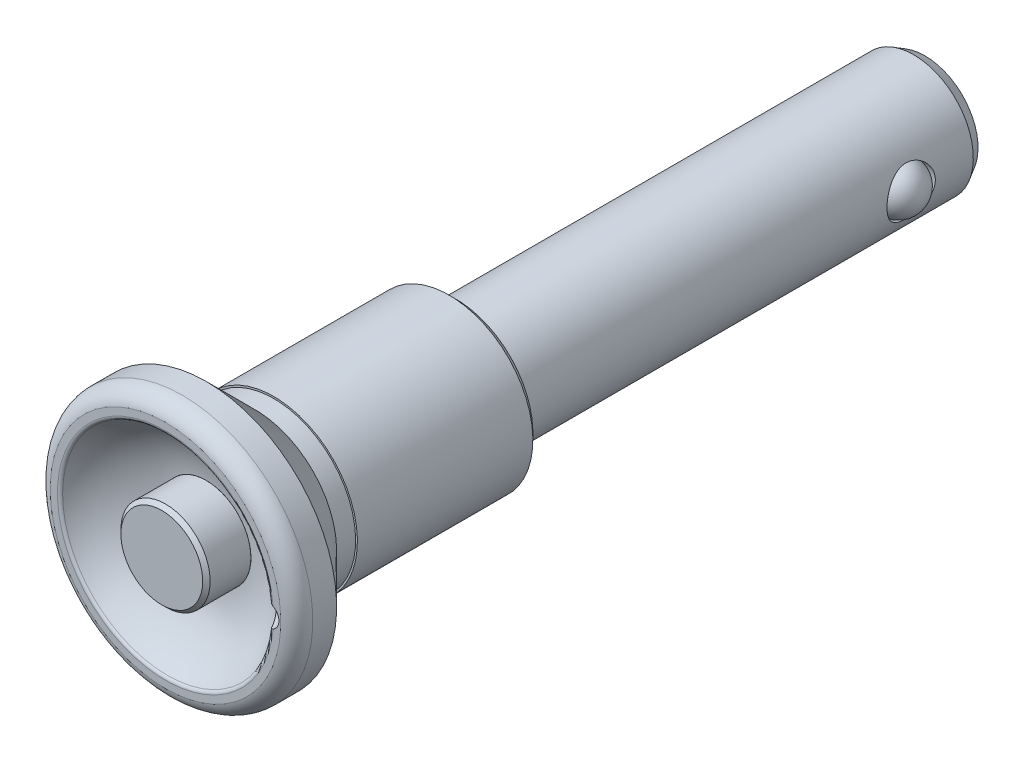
ISO-10303-21;
HEADER;
FILE_DESCRIPTION(('STEP AP214'),'2;1');
FILE_NAME('part.step','',(''),(''),'','','');
FILE_SCHEMA(('AUTOMOTIVE_DESIGN { 1 0 10303 214 1 1 1 1 }'));
ENDSEC;
DATA;
#1=APPLICATION_CONTEXT('core data for automotive mechanical design processes');
#2=APPLICATION_PROTOCOL_DEFINITION('international standard','automotive_design',2000,#1);
#3=PRODUCT_CONTEXT('',#1,'mechanical');
#4=PRODUCT('Part','Part','',(#3));
#5=PRODUCT_RELATED_PRODUCT_CATEGORY('part','',(#4));
#6=PRODUCT_DEFINITION_FORMATION('','',#4);
#7=PRODUCT_DEFINITION_CONTEXT('part definition',#1,'design');
#8=PRODUCT_DEFINITION('design','',#6,#7);
#9=PRODUCT_DEFINITION_SHAPE('','',#8);
#10=(LENGTH_UNIT() NAMED_UNIT(*) SI_UNIT(.MILLI.,.METRE.));
#11=(NAMED_UNIT(*) PLANE_ANGLE_UNIT() SI_UNIT($,.RADIAN.));
#12=(NAMED_UNIT(*) SI_UNIT($,.STERADIAN.) SOLID_ANGLE_UNIT());
#13=UNCERTAINTY_MEASURE_WITH_UNIT(LENGTH_MEASURE(1.E-05),#10,'distance_accuracy_value','');
#14=(GEOMETRIC_REPRESENTATION_CONTEXT(3) GLOBAL_UNCERTAINTY_ASSIGNED_CONTEXT((#13)) GLOBAL_UNIT_ASSIGNED_CONTEXT((#10,
#11,#12)) REPRESENTATION_CONTEXT('',''));
#15=CARTESIAN_POINT('',(0.,0.,0.));
#16=DIRECTION('',(0.,0.,1.));
#17=DIRECTION('',(1.,0.,0.));
#18=AXIS2_PLACEMENT_3D('',#15,#16,#17);
#19=CARTESIAN_POINT('',(9.,0.,-53.25));
#20=DIRECTION('',(1.,0.,0.));
#21=DIRECTION('',(0.,1.,0.));
#22=AXIS2_PLACEMENT_3D('',#19,#20,#21);
#23=CYLINDRICAL_SURFACE('',#22,3.25);
#24=CARTESIAN_POINT('',(-5.63465480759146,3.25,-53.25));
#25=CARTESIAN_POINT('',(-5.63465585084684,3.24999903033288,-53.3347265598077));
#26=CARTESIAN_POINT('',(-5.63657454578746,3.24668003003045,-53.4194635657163));
#27=CARTESIAN_POINT('',(-5.64416687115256,3.23345980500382,-53.5882644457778));
#28=CARTESIAN_POINT('',(-5.64984225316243,3.22355550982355,-53.6723279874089));
#29=CARTESIAN_POINT('',(-5.67225088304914,3.18408426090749,-53.9227685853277));
#30=CARTESIAN_POINT('',(-5.6943660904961,3.14475922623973,-54.0872467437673));
#31=CARTESIAN_POINT('',(-5.74975810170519,3.04227249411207,-54.4053993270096));
#32=CARTESIAN_POINT('',(-5.78297553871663,2.97923736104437,-54.5591260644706));
#33=CARTESIAN_POINT('',(-5.85672343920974,2.83150673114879,-54.8538197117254));
#34=CARTESIAN_POINT('',(-5.89725428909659,2.74681008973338,-54.994785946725));
#35=CARTESIAN_POINT('',(-5.98514477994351,2.54998143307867,-55.2727307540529));
#36=CARTESIAN_POINT('',(-6.03279191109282,2.4361644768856,-55.4084249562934));
#37=CARTESIAN_POINT('',(-6.12722511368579,2.18783002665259,-55.6597995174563));
#38=CARTESIAN_POINT('',(-6.17401074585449,2.05330228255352,-55.7754699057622));
#39=CARTESIAN_POINT('',(-6.26521517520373,1.75630332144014,-55.9911271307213));
#40=CARTESIAN_POINT('',(-6.30926291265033,1.59256097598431,-56.0895350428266));
#41=CARTESIAN_POINT('',(-6.38629670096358,1.24823211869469,-56.2568223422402));
#42=CARTESIAN_POINT('',(-6.41928971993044,1.06765630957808,-56.3257203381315));
#43=CARTESIAN_POINT('',(-6.46842511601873,0.70838520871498,-56.426948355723));
#44=CARTESIAN_POINT('',(-6.48559839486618,0.530468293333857,-56.4615292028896));
#45=CARTESIAN_POINT('',(-6.50500792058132,0.17059293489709,-56.5005535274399));
#46=CARTESIAN_POINT('',(-6.50725319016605,-0.0113630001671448,-56.5050152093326));
#47=CARTESIAN_POINT('',(-6.49704272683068,-0.357230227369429,-56.4845439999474));
#48=CARTESIAN_POINT('',(-6.4858466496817,-0.521336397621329,-56.462129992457));
#49=CARTESIAN_POINT('',(-6.45191454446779,-0.843095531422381,-56.3930510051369));
#50=CARTESIAN_POINT('',(-6.42917765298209,-1.00074801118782,-56.3463842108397));
#51=CARTESIAN_POINT('',(-6.37385308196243,-1.30787680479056,-56.2298199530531));
#52=CARTESIAN_POINT('',(-6.3411333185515,-1.45720962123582,-56.1596096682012));
#53=CARTESIAN_POINT('',(-6.26879358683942,-1.7423345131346,-55.9983862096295));
#54=CARTESIAN_POINT('',(-6.22917114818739,-1.8781217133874,-55.907365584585));
#55=CARTESIAN_POINT('',(-6.14233091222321,-2.14598519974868,-55.6972203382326));
#56=CARTESIAN_POINT('',(-6.09474919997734,-2.27650038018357,-55.5762535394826));
#57=CARTESIAN_POINT('',(-5.99975905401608,-2.51622424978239,-55.3146223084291));
#58=CARTESIAN_POINT('',(-5.95235078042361,-2.62541658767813,-55.1739429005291));
#59=CARTESIAN_POINT('',(-5.85980562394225,-2.82622074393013,-54.8657980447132));
#60=CARTESIAN_POINT('',(-5.81500282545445,-2.91628088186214,-54.6972003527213));
#61=CARTESIAN_POINT('',(-5.75683713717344,-3.02860289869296,-54.4329042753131));
#62=CARTESIAN_POINT('',(-5.73895226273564,-3.06225341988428,-54.3428861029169));
#63=CARTESIAN_POINT('',(-5.70689630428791,-3.12158760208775,-54.1596398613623));
#64=CARTESIAN_POINT('',(-5.69272293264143,-3.14727617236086,-54.0664138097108));
#65=CARTESIAN_POINT('',(-5.66966031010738,-3.18862076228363,-53.8849536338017));
#66=CARTESIAN_POINT('',(-5.66044290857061,-3.2049073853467,-53.7969042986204));
#67=CARTESIAN_POINT('',(-5.64606365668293,-3.23017214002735,-53.6194752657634));
#68=CARTESIAN_POINT('',(-5.64089969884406,-3.23915406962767,-53.5300962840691));
#69=CARTESIAN_POINT('',(-5.63484456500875,-3.24967714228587,-53.3507836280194));
#70=CARTESIAN_POINT('',(-5.63395180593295,-3.25122104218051,-53.2608501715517));
#71=CARTESIAN_POINT('',(-5.63646392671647,-3.24686086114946,-53.0812524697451));
#72=CARTESIAN_POINT('',(-5.63986851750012,-3.24095728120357,-52.9915882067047));
#73=CARTESIAN_POINT('',(-5.65514884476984,-3.21427724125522,-52.7437015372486));
#74=CARTESIAN_POINT('',(-5.67155983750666,-3.18549325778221,-52.5865355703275));
#75=CARTESIAN_POINT('',(-5.71556614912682,-3.10582623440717,-52.2796654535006));
#76=CARTESIAN_POINT('',(-5.74316508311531,-3.05493605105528,-52.1299637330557));
#77=CARTESIAN_POINT('',(-5.80791715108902,-2.93003236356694,-51.8342513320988));
#78=CARTESIAN_POINT('',(-5.84545364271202,-2.85505691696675,-51.6887328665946));
#79=CARTESIAN_POINT('',(-5.92551444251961,-2.68494755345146,-51.4115097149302));
#80=CARTESIAN_POINT('',(-5.96804130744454,-2.58980328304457,-51.2798121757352));
#81=CARTESIAN_POINT('',(-6.0597218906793,-2.36806394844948,-51.0166221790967));
#82=CARTESIAN_POINT('',(-6.10903611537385,-2.23901784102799,-50.8872408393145));
#83=CARTESIAN_POINT('',(-6.20410028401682,-1.9602691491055,-50.6513088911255));
#84=CARTESIAN_POINT('',(-6.24984902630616,-1.81055964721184,-50.5447659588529));
#85=CARTESIAN_POINT('',(-6.33418834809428,-1.48934321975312,-50.3551748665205));
#86=CARTESIAN_POINT('',(-6.3725595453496,-1.31736733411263,-50.272816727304));
#87=CARTESIAN_POINT('',(-6.43615086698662,-0.959533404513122,-50.1390207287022));
#88=CARTESIAN_POINT('',(-6.46138252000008,-0.773687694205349,-50.0875557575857));
#89=CARTESIAN_POINT('',(-6.49401408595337,-0.411781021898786,-50.0214370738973));
#90=CARTESIAN_POINT('',(-6.50283657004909,-0.236384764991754,-50.0038414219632));
#91=CARTESIAN_POINT('',(-6.50610717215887,0.11505074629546,-49.9972911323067));
#92=CARTESIAN_POINT('',(-6.50056030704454,0.291089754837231,-50.0083264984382));
#93=CARTESIAN_POINT('',(-6.47654468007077,0.62662898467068,-50.0567749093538));
#94=CARTESIAN_POINT('',(-6.4589493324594,0.786455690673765,-50.0924062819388));
#95=CARTESIAN_POINT('',(-6.41341105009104,1.09760306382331,-50.1866353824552));
#96=CARTESIAN_POINT('',(-6.38546662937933,1.24892250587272,-50.2452364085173));
#97=CARTESIAN_POINT('',(-6.320263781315,1.54603651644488,-50.3863521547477));
#98=CARTESIAN_POINT('',(-6.28265782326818,1.69131721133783,-50.4697832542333));
#99=CARTESIAN_POINT('',(-6.20206440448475,1.96642117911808,-50.6570473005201));
#100=CARTESIAN_POINT('',(-6.15907447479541,2.09623730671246,-50.7608896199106));
#101=CARTESIAN_POINT('',(-6.06695065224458,2.35031327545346,-50.9979647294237));
#102=CARTESIAN_POINT('',(-6.01763078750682,2.47273842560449,-51.1330928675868));
#103=CARTESIAN_POINT('',(-5.92193632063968,2.69389263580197,-51.4228073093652));
#104=CARTESIAN_POINT('',(-5.87556434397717,2.79260078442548,-51.5774106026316));
#105=CARTESIAN_POINT('',(-5.81174828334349,2.92195709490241,-51.8239315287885));
#106=CARTESIAN_POINT('',(-5.7911601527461,2.96243340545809,-51.91000421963));
#107=CARTESIAN_POINT('',(-5.75300321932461,3.03586895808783,-52.0859253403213));
#108=CARTESIAN_POINT('',(-5.73543286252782,3.0688320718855,-52.175771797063));
#109=CARTESIAN_POINT('',(-5.70405555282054,3.1267666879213,-52.3583807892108));
#110=CARTESIAN_POINT('',(-5.69023892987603,3.15175875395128,-52.4511351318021));
#111=CARTESIAN_POINT('',(-5.66692413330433,3.19349036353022,-52.6389664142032));
#112=CARTESIAN_POINT('',(-5.65742293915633,3.21023567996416,-52.7340416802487));
#113=CARTESIAN_POINT('',(-5.64512882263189,3.23178897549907,-52.8993457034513));
#114=CARTESIAN_POINT('',(-5.6412106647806,3.23861149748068,-52.9692357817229));
#115=CARTESIAN_POINT('',(-5.63597313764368,3.24771756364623,-53.1094148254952));
#116=CARTESIAN_POINT('',(-5.63465394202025,3.25000080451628,-53.1797038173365));
#117=CARTESIAN_POINT('',(-5.63465480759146,3.25,-53.25));
#118=B_SPLINE_CURVE_WITH_KNOTS('',3,(#24,#25,#26,#27,#28,#29,#30,#31,#32,#33,#34,#35,#36,#37,
#38,#39,#40,#41,#42,#43,#44,#45,#46,#47,#48,#49,#50,#51,#52,#53,#54,#55,#56,#57,#58,#59,#60,#61,
#62,#63,#64,#65,#66,#67,#68,#69,#70,#71,#72,#73,#74,#75,#76,#77,#78,#79,#80,#81,#82,#83,#84,#85,
#86,#87,#88,#89,#90,#91,#92,#93,#94,#95,#96,#97,#98,#99,#100,#101,#102,#103,#104,#105,#106,#107,
#108,#109,#110,#111,#112,#113,#114,#115,#116,#117),.UNSPECIFIED.,.T.,.F.,(4,2,2,2,2,2,2,2,2,2,2,
2,2,2,2,2,2,2,2,2,2,2,2,2,2,2,2,2,2,2,2,2,2,2,2,2,2,2,2,2,2,2,2,2,2,2,4),(0.,0.254102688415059,
0.508323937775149,1.01720671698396,1.52341076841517,2.02964157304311,2.5775608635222,
3.1257522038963,3.71082834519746,4.29553499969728,4.8386878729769,5.38151242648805,
5.87719988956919,6.37292444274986,6.87551542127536,7.37828663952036,7.92853225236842,
8.4791981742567,9.06474424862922,9.35763698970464,9.65034877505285,9.92001687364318,
10.1895446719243,10.4589725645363,10.7283823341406,11.2078563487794,11.6874854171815,
12.189332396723,12.6914376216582,13.2567245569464,13.8222011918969,14.4025190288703,
14.982326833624,15.5089851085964,16.0354595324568,16.5273252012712,17.0192615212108,
17.5322584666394,18.045491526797,18.6097361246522,19.1744764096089,19.4660899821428,
19.7575529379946,20.0482577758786,20.3387588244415,20.5495694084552,20.7603940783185),.UNSPECIFIED.);
#119=CARTESIAN_POINT('',(-6.04146080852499,-2.41093054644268,-55.429429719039));
#120=VERTEX_POINT('',#119);
#121=CARTESIAN_POINT('',(-6.04146080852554,2.41093054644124,-55.4294297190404));
#122=VERTEX_POINT('',#121);
#123=EDGE_CURVE('E78',#120,#122,#118,.T.);
#124=ORIENTED_EDGE('',*,*,#123,.F.);
#125=CARTESIAN_POINT('',(-6.50475478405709,0.,-56.5));
#126=CARTESIAN_POINT('',(-6.50475472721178,-0.182431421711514,-56.4999918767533));
#127=CARTESIAN_POINT('',(-6.50415200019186,-0.364995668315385,-56.4845876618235));
#128=CARTESIAN_POINT('',(-6.50173100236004,-0.725096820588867,-56.4233526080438));
#129=CARTESIAN_POINT('',(-6.49991125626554,-0.902627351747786,-56.3774848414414));
#130=CARTESIAN_POINT('',(-6.49502786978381,-1.24739374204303,-56.2566336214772));
#131=CARTESIAN_POINT('',(-6.49196480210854,-1.41463430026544,-56.1816635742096));
#132=CARTESIAN_POINT('',(-6.48454055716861,-1.73409069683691,-56.0047703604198));
#133=CARTESIAN_POINT('',(-6.4801797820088,-1.88631116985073,-55.9028555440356));
#134=CARTESIAN_POINT('',(-6.47005616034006,-2.17150162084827,-55.6749545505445));
#135=CARTESIAN_POINT('',(-6.46429309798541,-2.30446863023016,-55.5489646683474));
#136=CARTESIAN_POINT('',(-6.45117895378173,-2.54740669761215,-55.2764608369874));
#137=CARTESIAN_POINT('',(-6.44382727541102,-2.65736908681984,-55.129939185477));
#138=CARTESIAN_POINT('',(-6.42714023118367,-2.85122292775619,-54.8204831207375));
#139=CARTESIAN_POINT('',(-6.4178028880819,-2.93508818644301,-54.6575324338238));
#140=CARTESIAN_POINT('',(-6.39637595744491,-3.07415122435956,-54.3201765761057));
#141=CARTESIAN_POINT('',(-6.38429049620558,-3.12939158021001,-54.1457888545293));
#142=CARTESIAN_POINT('',(-6.36213145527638,-3.18943231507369,-53.8809438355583));
#143=CARTESIAN_POINT('',(-6.35414445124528,-3.20560626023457,-53.7927604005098));
#144=CARTESIAN_POINT('',(-6.33542581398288,-3.23060141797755,-53.6156617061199));
#145=CARTESIAN_POINT('',(-6.32469468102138,-3.239423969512,-53.5267465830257));
#146=CARTESIAN_POINT('',(-6.30342598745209,-3.24711535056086,-53.3937912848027));
#147=CARTESIAN_POINT('',(-6.29549176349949,-3.24875723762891,-53.3496150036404));
#148=CARTESIAN_POINT('',(-6.2788294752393,-3.24969197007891,-53.2959956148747));
#149=CARTESIAN_POINT('',(-6.27515773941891,-3.24982305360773,-53.2853466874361));
#150=CARTESIAN_POINT('',(-6.26890017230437,-3.24992109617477,-53.2727940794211));
#151=CARTESIAN_POINT('',(-6.26755615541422,-3.24993748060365,-53.2703066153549));
#152=CARTESIAN_POINT('',(-6.26457757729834,-3.24996385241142,-53.2655076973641));
#153=CARTESIAN_POINT('',(-6.26294427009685,-3.24997386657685,-53.2631955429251));
#154=CARTESIAN_POINT('',(-6.26029966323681,-3.2499838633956,-53.2602771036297));
#155=CARTESIAN_POINT('',(-6.259503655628,-3.24998625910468,-53.2594800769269));
#156=CARTESIAN_POINT('',(-6.25780472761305,-3.24999021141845,-53.2580094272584));
#157=CARTESIAN_POINT('',(-6.25690222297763,-3.24999177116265,-53.2573353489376));
#158=CARTESIAN_POINT('',(-6.2553817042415,-3.24999365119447,-53.2564327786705));
#159=CARTESIAN_POINT('',(-6.25480452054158,-3.2499942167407,-53.2561363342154));
#160=CARTESIAN_POINT('',(-6.25361148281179,-3.2499951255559,-53.2556343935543));
#161=CARTESIAN_POINT('',(-6.25299567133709,-3.24999546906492,-53.2554287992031));
#162=CARTESIAN_POINT('',(-6.25172949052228,-3.2499959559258,-53.2551293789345));
#163=CARTESIAN_POINT('',(-6.25107882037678,-3.24999609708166,-53.2550367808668));
#164=CARTESIAN_POINT('',(-6.24977202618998,-3.24999618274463,-53.2549813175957));
#165=CARTESIAN_POINT('',(-6.24911590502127,-3.24999612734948,-53.2550183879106));
#166=CARTESIAN_POINT('',(-6.24790373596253,-3.24999583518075,-53.2552035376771));
#167=CARTESIAN_POINT('',(-6.2473453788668,-3.24999562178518,-53.2553372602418));
#168=CARTESIAN_POINT('',(-6.2462549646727,-3.24999503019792,-53.2556861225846));
#169=CARTESIAN_POINT('',(-6.24572292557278,-3.24999465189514,-53.2559013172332));
#170=CARTESIAN_POINT('',(-6.24435696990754,-3.24999341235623,-53.2565561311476));
#171=CARTESIAN_POINT('',(-6.24354975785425,-3.24999239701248,-53.2570509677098));
#172=CARTESIAN_POINT('',(-6.24201857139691,-3.24998981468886,-53.2581558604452));
#173=CARTESIAN_POINT('',(-6.24129488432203,-3.24998824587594,-53.2587662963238));
#174=CARTESIAN_POINT('',(-6.23885580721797,-3.24998160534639,-53.2610537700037));
#175=CARTESIAN_POINT('',(-6.23732819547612,-3.24997485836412,-53.2629265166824));
#176=CARTESIAN_POINT('',(-6.23453858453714,-3.24995689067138,-53.2668604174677));
#177=CARTESIAN_POINT('',(-6.23327848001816,-3.24994563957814,-53.2689227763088));
#178=CARTESIAN_POINT('',(-6.22754077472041,-3.24987933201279,-53.2791362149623));
#179=CARTESIAN_POINT('',(-6.22414293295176,-3.24979089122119,-53.2878680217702));
#180=CARTESIAN_POINT('',(-6.21809518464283,-3.24953787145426,-53.3055431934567));
#181=CARTESIAN_POINT('',(-6.21544772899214,-3.24937304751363,-53.3144871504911));
#182=CARTESIAN_POINT('',(-6.2032902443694,-3.24836406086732,-53.359005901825));
#183=CARTESIAN_POINT('',(-6.19656627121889,-3.24694993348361,-53.3953332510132));
#184=CARTESIAN_POINT('',(-6.18452276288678,-3.24287823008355,-53.4681644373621));
#185=CARTESIAN_POINT('',(-6.17920844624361,-3.24021613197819,-53.5046684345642));
#186=CARTESIAN_POINT('',(-6.16455650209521,-3.23031427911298,-53.6146776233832));
#187=CARTESIAN_POINT('',(-6.15659209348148,-3.22116857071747,-53.6882307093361));
#188=CARTESIAN_POINT('',(-6.14213641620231,-3.19786349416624,-53.8345240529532));
#189=CARTESIAN_POINT('',(-6.13564314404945,-3.18371101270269,-53.9072652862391));
#190=CARTESIAN_POINT('',(-6.1175629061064,-3.13371051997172,-54.1243002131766));
#191=CARTESIAN_POINT('',(-6.10741258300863,-3.09035068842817,-54.2670577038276));
#192=CARTESIAN_POINT('',(-6.08705596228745,-2.97250185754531,-54.5766439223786));
#193=CARTESIAN_POINT('',(-6.07734814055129,-2.89321109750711,-54.7416864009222));
#194=CARTESIAN_POINT('',(-6.06000127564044,-2.70803402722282,-55.0561997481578));
#195=CARTESIAN_POINT('',(-6.05236213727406,-2.60214894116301,-55.2056713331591));
#196=CARTESIAN_POINT('',(-6.0387139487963,-2.36675113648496,-55.484797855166));
#197=CARTESIAN_POINT('',(-6.03270506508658,-2.23723600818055,-55.6144507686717));
#198=CARTESIAN_POINT('',(-6.02211352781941,-1.95825322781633,-55.8502113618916));
#199=CARTESIAN_POINT('',(-6.01753088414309,-1.80878543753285,-55.9563188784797));
#200=CARTESIAN_POINT('',(-6.00967850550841,-1.4941417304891,-56.1419551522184));
#201=CARTESIAN_POINT('',(-6.00640873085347,-1.32896628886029,-56.2214847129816));
#202=CARTESIAN_POINT('',(-6.00112064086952,-0.987593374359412,-56.3516982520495));
#203=CARTESIAN_POINT('',(-5.99910232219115,-0.811395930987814,-56.4023823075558));
#204=CARTESIAN_POINT('',(-5.99628586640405,-0.453052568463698,-56.4734446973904));
#205=CARTESIAN_POINT('',(-5.99548726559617,-0.270908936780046,-56.4938345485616));
#206=CARTESIAN_POINT('',(-5.9950974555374,0.0942183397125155,-56.5037635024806));
#207=CARTESIAN_POINT('',(-5.99550624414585,0.277201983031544,-56.4933026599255));
#208=CARTESIAN_POINT('',(-5.99753672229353,0.638781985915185,-56.4418331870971));
#209=CARTESIAN_POINT('',(-5.99915820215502,0.817379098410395,-56.4008298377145));
#210=CARTESIAN_POINT('',(-6.0036384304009,1.16515467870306,-56.2894496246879));
#211=CARTESIAN_POINT('',(-6.00649721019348,1.33433290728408,-56.2190720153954));
#212=CARTESIAN_POINT('',(-6.0135025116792,1.65849568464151,-56.0509346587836));
#213=CARTESIAN_POINT('',(-6.01764926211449,1.81347770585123,-55.9531700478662));
#214=CARTESIAN_POINT('',(-6.02732342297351,2.1047933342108,-55.7330763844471));
#215=CARTESIAN_POINT('',(-6.03285058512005,2.24113028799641,-55.6107517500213));
#216=CARTESIAN_POINT('',(-6.04544982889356,2.49132905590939,-55.3450117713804));
#217=CARTESIAN_POINT('',(-6.05252187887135,2.60519133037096,-55.2015968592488));
#218=CARTESIAN_POINT('',(-6.06857069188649,2.8073171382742,-54.8976741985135));
#219=CARTESIAN_POINT('',(-6.07754918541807,2.8955572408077,-54.7371509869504));
#220=CARTESIAN_POINT('',(-6.09807707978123,3.04397016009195,-54.4033061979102));
#221=CARTESIAN_POINT('',(-6.10963108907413,3.10409205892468,-54.2299620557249));
#222=CARTESIAN_POINT('',(-6.13064936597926,3.17169375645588,-53.9649701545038));
#223=CARTESIAN_POINT('',(-6.1382597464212,3.19045596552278,-53.8759096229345));
#224=CARTESIAN_POINT('',(-6.15556946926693,3.22042544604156,-53.6967504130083));
#225=CARTESIAN_POINT('',(-6.16526748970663,3.23163748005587,-53.6066524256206));
#226=CARTESIAN_POINT('',(-6.18408699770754,3.24288271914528,-53.4699792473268));
#227=CARTESIAN_POINT('',(-6.19122596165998,3.24569959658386,-53.4233942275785));
#228=CARTESIAN_POINT('',(-6.20522823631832,3.24841427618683,-53.3541203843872));
#229=CARTESIAN_POINT('',(-6.21044556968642,3.2490673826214,-53.3311266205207));
#230=CARTESIAN_POINT('',(-6.22071764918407,3.24967689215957,-53.2971645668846));
#231=CARTESIAN_POINT('',(-6.22455261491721,3.24981834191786,-53.2859249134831));
#232=CARTESIAN_POINT('',(-6.23115042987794,3.24992193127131,-53.2726935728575));
#233=CARTESIAN_POINT('',(-6.23257343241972,3.24993908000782,-53.2700667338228));
#234=CARTESIAN_POINT('',(-6.23574861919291,3.249966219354,-53.2650204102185));
#235=CARTESIAN_POINT('',(-6.23749823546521,3.24997626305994,-53.2625995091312));
#236=CARTESIAN_POINT('',(-6.24023323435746,3.24998546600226,-53.259747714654));
#237=CARTESIAN_POINT('',(-6.24095037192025,3.24998741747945,-53.2590662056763));
#238=CARTESIAN_POINT('',(-6.24247036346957,3.2499906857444,-53.2578055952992));
#239=CARTESIAN_POINT('',(-6.24327303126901,3.24999200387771,-53.2572262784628));
#240=CARTESIAN_POINT('',(-6.24469100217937,3.24999372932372,-53.2563932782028));
#241=CARTESIAN_POINT('',(-6.24527994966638,3.24999429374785,-53.2560953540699));
#242=CARTESIAN_POINT('',(-6.24649738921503,3.24999519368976,-53.2555949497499));
#243=CARTESIAN_POINT('',(-6.2471258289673,3.24999552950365,-53.2553923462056));
#244=CARTESIAN_POINT('',(-6.24841731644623,3.24999599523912,-53.2551042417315));
#245=CARTESIAN_POINT('',(-6.24908067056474,3.24999612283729,-53.2550200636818));
#246=CARTESIAN_POINT('',(-6.25041071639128,3.24999617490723,-53.2549864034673));
#247=CARTESIAN_POINT('',(-6.25107740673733,3.24999609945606,-53.2550368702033));
#248=CARTESIAN_POINT('',(-6.2522960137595,3.24999576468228,-53.2552474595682));
#249=CARTESIAN_POINT('',(-6.25285091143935,3.24999553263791,-53.2553912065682));
#250=CARTESIAN_POINT('',(-6.25393339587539,3.24999490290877,-53.2557583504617));
#251=CARTESIAN_POINT('',(-6.25446096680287,3.24999450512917,-53.25598179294));
#252=CARTESIAN_POINT('',(-6.25583840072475,3.24999318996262,-53.256667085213));
#253=CARTESIAN_POINT('',(-6.256659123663,3.24999210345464,-53.2571869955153));
#254=CARTESIAN_POINT('',(-6.2582140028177,3.24998934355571,-53.2583432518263));
#255=CARTESIAN_POINT('',(-6.25894784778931,3.24998766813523,-53.2589799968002));
#256=CARTESIAN_POINT('',(-6.26145971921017,3.24998046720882,-53.2613987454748));
#257=CARTESIAN_POINT('',(-6.26303482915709,3.2499730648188,-53.2633865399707));
#258=CARTESIAN_POINT('',(-6.26590679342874,3.24995329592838,-53.2675538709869));
#259=CARTESIAN_POINT('',(-6.26720163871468,3.24994089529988,-53.2697346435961));
#260=CARTESIAN_POINT('',(-6.2732032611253,3.24986641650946,-53.2807202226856));
#261=CARTESIAN_POINT('',(-6.27673982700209,3.24976552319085,-53.2901364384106));
#262=CARTESIAN_POINT('',(-6.28303094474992,3.24947572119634,-53.3091775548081));
#263=CARTESIAN_POINT('',(-6.28578309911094,3.24928654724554,-53.3188030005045));
#264=CARTESIAN_POINT('',(-6.29841795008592,3.24812694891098,-53.3667085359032));
#265=CARTESIAN_POINT('',(-6.30538389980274,3.24649816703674,-53.4057506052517));
#266=CARTESIAN_POINT('',(-6.31786268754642,3.2418065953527,-53.4839948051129));
#267=CARTESIAN_POINT('',(-6.32337031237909,3.23873876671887,-53.5231970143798));
#268=CARTESIAN_POINT('',(-6.33857182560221,3.22731083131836,-53.6414665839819));
#269=CARTESIAN_POINT('',(-6.34682941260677,3.21674112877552,-53.7205459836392));
#270=CARTESIAN_POINT('',(-6.3618080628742,3.18980788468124,-53.8776933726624));
#271=CARTESIAN_POINT('',(-6.36853100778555,3.17345150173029,-53.9557624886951));
#272=CARTESIAN_POINT('',(-6.38722831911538,3.11568291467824,-54.1883617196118));
#273=CARTESIAN_POINT('',(-6.3976986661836,3.0656017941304,-54.3409675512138));
#274=CARTESIAN_POINT('',(-6.41649095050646,2.94356822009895,-54.6369097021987));
#275=CARTESIAN_POINT('',(-6.42481661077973,2.87165414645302,-54.7802617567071));
#276=CARTESIAN_POINT('',(-6.43988100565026,2.70750791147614,-55.0548470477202));
#277=CARTESIAN_POINT('',(-6.44662026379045,2.61528247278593,-55.1860842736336));
#278=CARTESIAN_POINT('',(-6.45968563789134,2.39819149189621,-55.4510135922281));
#279=CARTESIAN_POINT('',(-6.4658208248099,2.27056101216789,-55.58246220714));
#280=CARTESIAN_POINT('',(-6.4766559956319,1.99493696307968,-55.82218121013));
#281=CARTESIAN_POINT('',(-6.48135496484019,1.84692910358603,-55.9304351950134));
#282=CARTESIAN_POINT('',(-6.4894329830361,1.53479241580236,-56.1205971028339));
#283=CARTESIAN_POINT('',(-6.49281172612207,1.37065986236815,-56.2024989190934));
#284=CARTESIAN_POINT('',(-6.49830922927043,1.03110256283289,-56.3374958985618));
#285=CARTESIAN_POINT('',(-6.50042961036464,0.855692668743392,-56.3906281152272));
#286=CARTESIAN_POINT('',(-6.50287966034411,0.565964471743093,-56.4523665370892));
#287=CARTESIAN_POINT('',(-6.50358302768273,0.453533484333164,-56.4702066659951));
#288=CARTESIAN_POINT('',(-6.50452060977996,0.227418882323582,-56.4940259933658));
#289=CARTESIAN_POINT('',(-6.5047548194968,0.113735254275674,-56.5000050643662));
#290=CARTESIAN_POINT('',(-6.50475478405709,0.,-56.5));
#291=B_SPLINE_CURVE_WITH_KNOTS('',3,(#125,#126,#127,#128,#129,#130,#131,#132,#133,#134,#135,
#136,#137,#138,#139,#140,#141,#142,#143,#144,#145,#146,#147,#148,#149,#150,#151,#152,#153,#154,
#155,#156,#157,#158,#159,#160,#161,#162,#163,#164,#165,#166,#167,#168,#169,#170,#171,#172,#173,
#174,#175,#176,#177,#178,#179,#180,#181,#182,#183,#184,#185,#186,#187,#188,#189,#190,#191,#192,
#193,#194,#195,#196,#197,#198,#199,#200,#201,#202,#203,#204,#205,#206,#207,#208,#209,#210,#211,
#212,#213,#214,#215,#216,#217,#218,#219,#220,#221,#222,#223,#224,#225,#226,#227,#228,#229,#230,
#231,#232,#233,#234,#235,#236,#237,#238,#239,#240,#241,#242,#243,#244,#245,#246,#247,#248,#249,
#250,#251,#252,#253,#254,#255,#256,#257,#258,#259,#260,#261,#262,#263,#264,#265,#266,#267,#268,
#269,#270,#271,#272,#273,#274,#275,#276,#277,#278,#279,#280,#281,#282,#283,#284,#285,#286,#287,
#288,#289,#290),.UNSPECIFIED.,.T.,.F.,(4,2,2,2,2,2,2,2,2,2,2,2,2,2,2,2,2,2,2,2,2,2,2,2,2,2,2,2,
2,2,2,2,2,2,2,2,2,2,2,2,2,2,2,2,2,2,2,2,2,2,2,2,2,2,2,2,2,2,2,2,2,2,2,2,2,2,2,2,2,2,2,2,2,2,2,2,
2,2,2,2,2,2,4),(0.,0.546878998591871,1.09442213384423,1.64171333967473,2.18883513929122,
2.73604120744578,3.28345310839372,3.83141267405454,4.37855484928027,4.64829359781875,
4.91798320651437,5.05238497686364,5.08600715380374,5.09448207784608,5.1029211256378,
5.10629355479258,5.10965322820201,5.11159396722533,5.11353260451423,5.11549212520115,
5.11745067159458,5.11916600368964,5.12088249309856,5.1237064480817,5.126539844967,
5.13373370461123,5.14097693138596,5.16888967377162,5.19689256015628,5.30747569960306,
5.41846267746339,5.64180446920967,5.86484024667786,6.31195514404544,6.85939401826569,
7.40680769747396,7.95427723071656,8.50175055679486,9.04920732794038,9.59666263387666,
10.1439097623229,10.6911559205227,11.2383074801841,11.7854729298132,12.3327356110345,
12.879899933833,13.427053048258,13.9747049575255,14.5233447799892,14.7970709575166,
15.0706243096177,15.2120965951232,15.2828520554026,15.3182754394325,15.3272316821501,
15.3361202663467,15.3390824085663,15.3420382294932,15.3440119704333,15.3459831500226,
15.3479761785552,15.3499684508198,15.3516812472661,15.3533950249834,15.3562927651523,
15.3592005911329,15.3667496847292,15.3743512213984,15.4043178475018,15.4343751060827,
15.5531053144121,15.672254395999,15.912531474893,16.1525123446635,16.6334226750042,
17.1134924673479,17.5934036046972,18.1407106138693,18.688403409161,19.2362230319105,
19.7833354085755,20.1242786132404,20.465225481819),.UNSPECIFIED.);
#292=EDGE_CURVE('E62',#122,#120,#291,.T.);
#293=ORIENTED_EDGE('',*,*,#292,.F.);
#294=EDGE_LOOP('',(#124,#293));
#295=FACE_BOUND('',#294,.T.);
#296=CARTESIAN_POINT('',(-7.31009575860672,3.25,-53.25));
#297=CARTESIAN_POINT('',(-7.31009732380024,3.24999819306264,-53.1630599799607));
#298=CARTESIAN_POINT('',(-7.31165386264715,3.24650411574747,-53.076090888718));
#299=CARTESIAN_POINT('',(-7.31782159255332,3.23257358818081,-52.9028024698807));
#300=CARTESIAN_POINT('',(-7.3224347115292,3.22213275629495,-52.8164835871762));
#301=CARTESIAN_POINT('',(-7.34068494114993,3.18046303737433,-52.5591175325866));
#302=CARTESIAN_POINT('',(-7.35873227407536,3.13888730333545,-52.3899262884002));
#303=CARTESIAN_POINT('',(-7.40417815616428,3.03010582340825,-52.062264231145));
#304=CARTESIAN_POINT('',(-7.43153982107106,2.9630010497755,-51.903754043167));
#305=CARTESIAN_POINT('',(-7.49246721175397,2.80536216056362,-51.6002509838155));
#306=CARTESIAN_POINT('',(-7.5260312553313,2.71483439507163,-51.4552544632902));
#307=CARTESIAN_POINT('',(-7.59780469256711,2.50719740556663,-51.174284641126));
#308=CARTESIAN_POINT('',(-7.63616661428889,2.38892405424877,-51.0392107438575));
#309=CARTESIAN_POINT('',(-7.71195570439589,2.13160039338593,-50.790151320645));
#310=CARTESIAN_POINT('',(-7.74938251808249,1.99254233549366,-50.6761736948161));
#311=CARTESIAN_POINT('',(-7.82092244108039,1.69061377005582,-50.4680431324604));
#312=CARTESIAN_POINT('',(-7.85483757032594,1.52700226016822,-50.3748909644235));
#313=CARTESIAN_POINT('',(-7.91367836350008,1.18480623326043,-50.2178173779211));
#314=CARTESIAN_POINT('',(-7.93860783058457,1.00622809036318,-50.1538835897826));
#315=CARTESIAN_POINT('',(-7.97558858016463,0.648594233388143,-50.0602869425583));
#316=CARTESIAN_POINT('',(-7.98821898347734,0.470004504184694,-50.0290769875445));
#317=CARTESIAN_POINT('',(-8.00127556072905,0.10970598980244,-49.9968257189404));
#318=CARTESIAN_POINT('',(-8.00170642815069,-0.072001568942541,-49.9957728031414));
#319=CARTESIAN_POINT('',(-7.99066355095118,-0.422169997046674,-50.0230312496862));
#320=CARTESIAN_POINT('',(-7.97987772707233,-0.590788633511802,-50.0496457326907));
#321=CARTESIAN_POINT('',(-7.94854711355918,-0.920926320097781,-50.1285888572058));
#322=CARTESIAN_POINT('',(-7.92800160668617,-1.08244484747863,-50.1809193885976));
#323=CARTESIAN_POINT('',(-7.87875951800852,-1.39673026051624,-50.3104453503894));
#324=CARTESIAN_POINT('',(-7.84994411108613,-1.54932739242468,-50.3880056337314));
#325=CARTESIAN_POINT('',(-7.78700709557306,-1.83973693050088,-50.5654420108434));
#326=CARTESIAN_POINT('',(-7.75288364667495,-1.97754418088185,-50.6653258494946));
#327=CARTESIAN_POINT('',(-7.68006213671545,-2.2443353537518,-50.8924212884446));
#328=CARTESIAN_POINT('',(-7.6412107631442,-2.37209684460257,-51.0210218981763));
#329=CARTESIAN_POINT('',(-7.56507027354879,-2.60475126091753,-51.2979515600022));
#330=CARTESIAN_POINT('',(-7.52778170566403,-2.70963621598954,-51.4462874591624));
#331=CARTESIAN_POINT('',(-7.45792668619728,-2.89648137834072,-51.7641116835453));
#332=CARTESIAN_POINT('',(-7.42553491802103,-2.97766171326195,-51.9341001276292));
#333=CARTESIAN_POINT('',(-7.37120049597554,-3.10975325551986,-52.2870012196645));
#334=CARTESIAN_POINT('',(-7.34925080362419,-3.16068485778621,-52.4699050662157));
#335=CARTESIAN_POINT('',(-7.32000769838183,-3.22780941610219,-52.8312282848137));
#336=CARTESIAN_POINT('',(-7.31188362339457,-3.24597550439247,-53.009212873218));
#337=CARTESIAN_POINT('',(-7.30884184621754,-3.25282336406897,-53.365834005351));
#338=CARTESIAN_POINT('',(-7.31391993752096,-3.24151452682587,-53.544470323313));
#339=CARTESIAN_POINT('',(-7.33585566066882,-3.19153169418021,-53.8861339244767));
#340=CARTESIAN_POINT('',(-7.35199401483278,-3.15452692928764,-54.0494573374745));
#341=CARTESIAN_POINT('',(-7.39332962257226,-3.05638531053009,-54.3674592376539));
#342=CARTESIAN_POINT('',(-7.41852892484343,-2.99524299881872,-54.5221357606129));
#343=CARTESIAN_POINT('',(-7.47641704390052,-2.84775217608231,-54.8255746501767));
#344=CARTESIAN_POINT('',(-7.50937194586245,-2.76046786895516,-54.9738297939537));
#345=CARTESIAN_POINT('',(-7.57866264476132,-2.56411776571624,-55.2542780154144));
#346=CARTESIAN_POINT('',(-7.61499984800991,-2.4550428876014,-55.3864643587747));
#347=CARTESIAN_POINT('',(-7.69032288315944,-2.20834452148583,-55.6415580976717));
#348=CARTESIAN_POINT('',(-7.72929827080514,-2.06917373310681,-55.7629779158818));
#349=CARTESIAN_POINT('',(-7.80289864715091,-1.77151095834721,-55.980984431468));
#350=CARTESIAN_POINT('',(-7.83752340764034,-1.6130179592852,-56.0775698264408));
#351=CARTESIAN_POINT('',(-7.89867149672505,-1.28045225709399,-56.2428966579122));
#352=CARTESIAN_POINT('',(-7.9251887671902,-1.10636802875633,-56.311617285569));
#353=CARTESIAN_POINT('',(-7.9670167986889,-0.747763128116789,-56.4183263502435));
#354=CARTESIAN_POINT('',(-7.98233386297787,-0.5632483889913,-56.4563320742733));
#355=CARTESIAN_POINT('',(-7.99934332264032,-0.202353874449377,-56.4984343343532));
#356=CARTESIAN_POINT('',(-8.00187969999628,-0.0262571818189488,-56.5046318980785));
#357=CARTESIAN_POINT('',(-7.99534247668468,0.324389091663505,-56.4885273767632));
#358=CARTESIAN_POINT('',(-7.98627073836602,0.498938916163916,-56.4662298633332));
#359=CARTESIAN_POINT('',(-7.95796712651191,0.835717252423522,-56.3952733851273));
#360=CARTESIAN_POINT('',(-7.93907454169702,0.998161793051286,-56.3474934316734));
#361=CARTESIAN_POINT('',(-7.89317001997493,1.31268916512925,-56.2278639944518));
#362=CARTESIAN_POINT('',(-7.86615650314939,1.46476997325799,-56.1560098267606));
#363=CARTESIAN_POINT('',(-7.80514921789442,1.76171759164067,-55.9866698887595));
#364=CARTESIAN_POINT('',(-7.77089769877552,1.90595939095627,-55.8881831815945));
#365=CARTESIAN_POINT('',(-7.69951725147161,2.17647386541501,-55.6698538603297));
#366=CARTESIAN_POINT('',(-7.6623873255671,2.30274026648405,-55.5500038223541));
#367=CARTESIAN_POINT('',(-7.5864657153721,2.54210677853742,-55.2833069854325));
#368=CARTESIAN_POINT('',(-7.54772000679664,2.65384474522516,-55.1352223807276));
#369=CARTESIAN_POINT('',(-7.47545536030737,2.85108049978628,-54.8210469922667));
#370=CARTESIAN_POINT('',(-7.44193927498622,2.93656399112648,-54.6549464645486));
#371=CARTESIAN_POINT('',(-7.3989625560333,3.04249490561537,-54.3964499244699));
#372=CARTESIAN_POINT('',(-7.38588609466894,3.0740182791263,-54.3090459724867));
#373=CARTESIAN_POINT('',(-7.36253208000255,3.12954209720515,-54.1315309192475));
#374=CARTESIAN_POINT('',(-7.35225317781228,3.15354616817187,-54.0414211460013));
#375=CARTESIAN_POINT('',(-7.3348971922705,3.19370630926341,-53.8594307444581));
#376=CARTESIAN_POINT('',(-7.32781154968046,3.20988336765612,-53.7675555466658));
#377=CARTESIAN_POINT('',(-7.31707726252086,3.23427923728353,-53.5826022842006));
#378=CARTESIAN_POINT('',(-7.31342609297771,3.24250389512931,-53.4895251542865));
#379=CARTESIAN_POINT('',(-7.31058346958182,3.24890274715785,-53.3475459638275));
#380=CARTESIAN_POINT('',(-7.31009488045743,3.25000101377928,-53.2987775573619));
#381=CARTESIAN_POINT('',(-7.31009575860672,3.25,-53.25));
#382=B_SPLINE_CURVE_WITH_KNOTS('',3,(#296,#297,#298,#299,#300,#301,#302,#303,#304,#305,#306,
#307,#308,#309,#310,#311,#312,#313,#314,#315,#316,#317,#318,#319,#320,#321,#322,#323,#324,#325,
#326,#327,#328,#329,#330,#331,#332,#333,#334,#335,#336,#337,#338,#339,#340,#341,#342,#343,#344,
#345,#346,#347,#348,#349,#350,#351,#352,#353,#354,#355,#356,#357,#358,#359,#360,#361,#362,#363,
#364,#365,#366,#367,#368,#369,#370,#371,#372,#373,#374,#375,#376,#377,#378,#379,#380,#381),
.UNSPECIFIED.,.T.,.F.,(4,2,2,2,2,2,2,2,2,2,2,2,2,2,2,2,2,2,2,2,2,2,2,2,2,2,2,2,2,2,2,2,2,2,2,2,
2,2,2,2,2,2,4),(0.,0.260777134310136,0.521718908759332,1.04438772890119,1.56501043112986,
2.08549213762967,2.63385451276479,3.18242182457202,3.75341190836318,4.32416003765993,
4.8665061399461,5.40864358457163,5.91938723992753,6.43016843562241,6.94869149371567,
7.4673947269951,8.02109099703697,8.57497987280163,9.14544243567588,9.71551993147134,
10.2499491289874,10.7842080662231,11.2866605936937,11.7892267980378,12.3125257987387,
12.8360433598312,13.3996836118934,13.9633534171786,14.5274433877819,15.0912156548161,
15.6172206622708,16.1431412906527,16.6519938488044,17.1609454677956,17.6926147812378,
18.2244692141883,18.7904042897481,19.3566469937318,19.6378242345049,19.9188656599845,
20.1991492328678,20.4792265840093,20.6255351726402),.UNSPECIFIED.);
#383=CARTESIAN_POINT('',(-7.31009575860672,3.25,-53.25));
#384=VERTEX_POINT('',#383);
#385=EDGE_CURVE('E69',#384,#384,#382,.T.);
#386=ORIENTED_EDGE('',*,*,#385,.F.);
#387=EDGE_LOOP('',(#386));
#388=FACE_BOUND('',#387,.T.);
#389=ADVANCED_FACE('F14',(#295,#388),#23,.F.);
#390=CARTESIAN_POINT('',(0.,0.,-63.1));
#391=DIRECTION('',(0.,0.,-1.));
#392=DIRECTION('',(0.,1.,0.));
#393=AXIS2_PLACEMENT_3D('',#390,#391,#392);
#394=CYLINDRICAL_SURFACE('',#393,3.);
#395=CARTESIAN_POINT('',(0.,0.,-57.6));
#396=DIRECTION('',(0.,0.,-1.));
#397=DIRECTION('',(0.,1.,0.));
#398=AXIS2_PLACEMENT_3D('',#395,#396,#397);
#399=CIRCLE('',#398,3.);
#400=CARTESIAN_POINT('',(0.,3.,-57.6));
#401=VERTEX_POINT('',#400);
#402=EDGE_CURVE('E9',#401,#401,#399,.T.);
#403=ORIENTED_EDGE('',*,*,#402,.F.);
#404=EDGE_LOOP('',(#403));
#405=FACE_BOUND('',#404,.T.);
#406=CARTESIAN_POINT('',(0.,0.,-63.1));
#407=DIRECTION('',(0.,0.,-1.));
#408=DIRECTION('',(0.,1.,0.));
#409=AXIS2_PLACEMENT_3D('',#406,#407,#408);
#410=CIRCLE('',#409,3.);
#411=CARTESIAN_POINT('',(0.,3.,-63.1));
#412=VERTEX_POINT('',#411);
#413=EDGE_CURVE('E307',#412,#412,#410,.T.);
#414=ORIENTED_EDGE('',*,*,#413,.T.);
#415=EDGE_LOOP('',(#414));
#416=FACE_BOUND('',#415,.T.);
#417=ADVANCED_FACE('F272',(#405,#416),#394,.F.);
#418=CARTESIAN_POINT('',(0.,0.,-63.1));
#419=DIRECTION('',(0.,0.,-1.));
#420=DIRECTION('',(0.,1.,0.));
#421=AXIS2_PLACEMENT_3D('',#418,#419,#420);
#422=CYLINDRICAL_SURFACE('',#421,8.);
#423=CARTESIAN_POINT('',(7.31009575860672,3.25,-53.25));
#424=CARTESIAN_POINT('',(7.31009732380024,3.24999819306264,-53.3369400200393));
#425=CARTESIAN_POINT('',(7.31165386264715,3.24650411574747,-53.423909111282));
#426=CARTESIAN_POINT('',(7.31782159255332,3.23257358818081,-53.5971975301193));
#427=CARTESIAN_POINT('',(7.3224347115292,3.22213275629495,-53.6835164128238));
#428=CARTESIAN_POINT('',(7.34068494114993,3.18046303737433,-53.9408824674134));
#429=CARTESIAN_POINT('',(7.35873227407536,3.13888730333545,-54.1100737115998));
#430=CARTESIAN_POINT('',(7.40417815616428,3.03010582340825,-54.437735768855));
#431=CARTESIAN_POINT('',(7.43153982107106,2.96300104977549,-54.596245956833));
#432=CARTESIAN_POINT('',(7.49246721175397,2.80536216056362,-54.8997490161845));
#433=CARTESIAN_POINT('',(7.5260312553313,2.71483439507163,-55.0447455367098));
#434=CARTESIAN_POINT('',(7.59780469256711,2.50719740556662,-55.325715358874));
#435=CARTESIAN_POINT('',(7.6361666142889,2.38892405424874,-55.4607892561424));
#436=CARTESIAN_POINT('',(7.7119557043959,2.13160039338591,-55.709848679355));
#437=CARTESIAN_POINT('',(7.74938251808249,1.99254233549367,-55.823826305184));
#438=CARTESIAN_POINT('',(7.82092244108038,1.69061377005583,-56.0319568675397));
#439=CARTESIAN_POINT('',(7.85483757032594,1.5270022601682,-56.1251090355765));
#440=CARTESIAN_POINT('',(7.91367836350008,1.18480623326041,-56.2821826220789));
#441=CARTESIAN_POINT('',(7.93860783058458,1.00622809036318,-56.3461164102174));
#442=CARTESIAN_POINT('',(7.97558858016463,0.648594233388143,-56.4397130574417));
#443=CARTESIAN_POINT('',(7.98821898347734,0.470004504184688,-56.4709230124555));
#444=CARTESIAN_POINT('',(8.00127556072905,0.109705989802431,-56.5031742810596));
#445=CARTESIAN_POINT('',(8.00170642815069,-0.0720015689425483,-56.5042271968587));
#446=CARTESIAN_POINT('',(7.99066355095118,-0.422169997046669,-56.4769687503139));
#447=CARTESIAN_POINT('',(7.97987772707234,-0.590788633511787,-56.4503542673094));
#448=CARTESIAN_POINT('',(7.94854711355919,-0.920926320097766,-56.3714111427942));
#449=CARTESIAN_POINT('',(7.92800160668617,-1.08244484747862,-56.3190806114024));
#450=CARTESIAN_POINT('',(7.87875951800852,-1.39673026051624,-56.1895546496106));
#451=CARTESIAN_POINT('',(7.84994411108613,-1.54932739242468,-56.1119943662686));
#452=CARTESIAN_POINT('',(7.78700709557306,-1.83973693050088,-55.9345579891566));
#453=CARTESIAN_POINT('',(7.75288364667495,-1.97754418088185,-55.8346741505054));
#454=CARTESIAN_POINT('',(7.68006213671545,-2.2443353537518,-55.6075787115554));
#455=CARTESIAN_POINT('',(7.6412107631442,-2.37209684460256,-55.4789781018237));
#456=CARTESIAN_POINT('',(7.56507027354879,-2.60475126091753,-55.2020484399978));
#457=CARTESIAN_POINT('',(7.52778170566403,-2.70963621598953,-55.0537125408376));
#458=CARTESIAN_POINT('',(7.45792668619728,-2.89648137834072,-54.7358883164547));
#459=CARTESIAN_POINT('',(7.42553491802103,-2.97766171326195,-54.5658998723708));
#460=CARTESIAN_POINT('',(7.37120049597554,-3.10975325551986,-54.2129987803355));
#461=CARTESIAN_POINT('',(7.34925080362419,-3.16068485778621,-54.0300949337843));
#462=CARTESIAN_POINT('',(7.32000769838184,-3.22780941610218,-53.6687717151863));
#463=CARTESIAN_POINT('',(7.31188362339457,-3.24597550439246,-53.4907871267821));
#464=CARTESIAN_POINT('',(7.30884184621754,-3.25282336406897,-53.1341659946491));
#465=CARTESIAN_POINT('',(7.31391993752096,-3.24151452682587,-52.9555296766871));
#466=CARTESIAN_POINT('',(7.33585566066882,-3.19153169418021,-52.6138660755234));
#467=CARTESIAN_POINT('',(7.35199401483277,-3.15452692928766,-52.4505426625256));
#468=CARTESIAN_POINT('',(7.39332962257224,-3.0563853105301,-52.1325407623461));
#469=CARTESIAN_POINT('',(7.41852892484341,-2.99524299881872,-51.9778642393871));
#470=CARTESIAN_POINT('',(7.47641704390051,-2.84775217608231,-51.6744253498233));
#471=CARTESIAN_POINT('',(7.50937194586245,-2.76046786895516,-51.5261702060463));
#472=CARTESIAN_POINT('',(7.57866264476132,-2.56411776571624,-51.2457219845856));
#473=CARTESIAN_POINT('',(7.61499984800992,-2.4550428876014,-51.1135356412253));
#474=CARTESIAN_POINT('',(7.69032288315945,-2.20834452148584,-50.8584419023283));
#475=CARTESIAN_POINT('',(7.72929827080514,-2.06917373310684,-50.7370220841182));
#476=CARTESIAN_POINT('',(7.80289864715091,-1.77151095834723,-50.519015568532));
#477=CARTESIAN_POINT('',(7.83752340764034,-1.6130179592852,-50.4224301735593));
#478=CARTESIAN_POINT('',(7.89867149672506,-1.28045225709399,-50.2571033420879));
#479=CARTESIAN_POINT('',(7.9251887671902,-1.10636802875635,-50.188382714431));
#480=CARTESIAN_POINT('',(7.96701679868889,-0.747763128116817,-50.0816736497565));
#481=CARTESIAN_POINT('',(7.98233386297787,-0.563248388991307,-50.0436679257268));
#482=CARTESIAN_POINT('',(7.99934332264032,-0.202353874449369,-50.0015656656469));
#483=CARTESIAN_POINT('',(8.00187969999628,-0.026257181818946,-49.9953681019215));
#484=CARTESIAN_POINT('',(7.99534247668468,0.324389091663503,-50.0114726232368));
#485=CARTESIAN_POINT('',(7.98627073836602,0.498938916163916,-50.0337701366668));
#486=CARTESIAN_POINT('',(7.95796712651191,0.835717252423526,-50.1047266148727));
#487=CARTESIAN_POINT('',(7.93907454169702,0.998161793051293,-50.1525065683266));
#488=CARTESIAN_POINT('',(7.89317001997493,1.31268916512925,-50.2721360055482));
#489=CARTESIAN_POINT('',(7.86615650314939,1.46476997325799,-50.3439901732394));
#490=CARTESIAN_POINT('',(7.80514921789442,1.76171759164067,-50.5133301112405));
#491=CARTESIAN_POINT('',(7.77089769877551,1.90595939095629,-50.6118168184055));
#492=CARTESIAN_POINT('',(7.6995172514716,2.17647386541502,-50.8301461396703));
#493=CARTESIAN_POINT('',(7.66238732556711,2.30274026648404,-50.949996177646));
#494=CARTESIAN_POINT('',(7.5864657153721,2.54210677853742,-51.2166930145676));
#495=CARTESIAN_POINT('',(7.54772000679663,2.65384474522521,-51.3647776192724));
#496=CARTESIAN_POINT('',(7.47545536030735,2.85108049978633,-51.6789530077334));
#497=CARTESIAN_POINT('',(7.44193927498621,2.93656399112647,-51.8450535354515));
#498=CARTESIAN_POINT('',(7.39896255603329,3.04249490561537,-52.1035500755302));
#499=CARTESIAN_POINT('',(7.38588609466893,3.07401827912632,-52.1909540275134));
#500=CARTESIAN_POINT('',(7.36253208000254,3.12954209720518,-52.3684690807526));
#501=CARTESIAN_POINT('',(7.35225317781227,3.15354616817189,-52.4585788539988));
#502=CARTESIAN_POINT('',(7.33489719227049,3.19370630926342,-52.640569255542));
#503=CARTESIAN_POINT('',(7.32781154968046,3.20988336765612,-52.7324444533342));
#504=CARTESIAN_POINT('',(7.31707726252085,3.23427923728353,-52.9173977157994));
#505=CARTESIAN_POINT('',(7.31342609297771,3.24250389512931,-53.0104748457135));
#506=CARTESIAN_POINT('',(7.31058346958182,3.24890274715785,-53.1524540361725));
#507=CARTESIAN_POINT('',(7.31009488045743,3.25000101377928,-53.2012224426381));
#508=CARTESIAN_POINT('',(7.31009575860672,3.25,-53.25));
#509=B_SPLINE_CURVE_WITH_KNOTS('',3,(#423,#424,#425,#426,#427,#428,#429,#430,#431,#432,#433,
#434,#435,#436,#437,#438,#439,#440,#441,#442,#443,#444,#445,#446,#447,#448,#449,#450,#451,#452,
#453,#454,#455,#456,#457,#458,#459,#460,#461,#462,#463,#464,#465,#466,#467,#468,#469,#470,#471,
#472,#473,#474,#475,#476,#477,#478,#479,#480,#481,#482,#483,#484,#485,#486,#487,#488,#489,#490,
#491,#492,#493,#494,#495,#496,#497,#498,#499,#500,#501,#502,#503,#504,#505,#506,#507,#508),
.UNSPECIFIED.,.T.,.F.,(4,2,2,2,2,2,2,2,2,2,2,2,2,2,2,2,2,2,2,2,2,2,2,2,2,2,2,2,2,2,2,2,2,2,2,2,
2,2,2,2,2,2,4),(0.,0.260777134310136,0.521718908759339,1.0443877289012,1.56501043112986,
2.08549213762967,2.63385451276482,3.18242182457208,3.75341190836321,4.32416003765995,
4.86650613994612,5.40864358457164,5.91938723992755,6.43016843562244,6.9486914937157,
7.46739472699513,8.021090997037,8.57497987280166,9.14544243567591,9.71551993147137,
10.2499491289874,10.784208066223,11.2866605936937,11.7892267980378,12.3125257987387,
12.8360433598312,13.3996836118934,13.9633534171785,14.5274433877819,15.091215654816,
15.6172206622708,16.1431412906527,16.6519938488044,17.1609454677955,17.6926147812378,
18.2244692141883,18.7904042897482,19.3566469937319,19.637824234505,19.9188656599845,
20.1991492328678,20.4792265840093,20.6255351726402),.UNSPECIFIED.);
#510=CARTESIAN_POINT('',(7.31009575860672,3.25,-53.25));
#511=VERTEX_POINT('',#510);
#512=EDGE_CURVE('E292',#511,#511,#509,.T.);
#513=ORIENTED_EDGE('',*,*,#512,.T.);
#514=EDGE_LOOP('',(#513));
#515=FACE_BOUND('',#514,.T.);
#516=CARTESIAN_POINT('',(0.,0.,-61.6));
#517=DIRECTION('',(0.,0.,-1.));
#518=DIRECTION('',(0.,1.,0.));
#519=AXIS2_PLACEMENT_3D('',#516,#517,#518);
#520=CIRCLE('',#519,8.);
#521=CARTESIAN_POINT('',(0.,8.,-61.6));
#522=VERTEX_POINT('',#521);
#523=EDGE_CURVE('E75',#522,#522,#520,.T.);
#524=ORIENTED_EDGE('',*,*,#523,.F.);
#525=EDGE_LOOP('',(#524));
#526=FACE_BOUND('',#525,.T.);
#527=ORIENTED_EDGE('',*,*,#385,.T.);
#528=EDGE_LOOP('',(#527));
#529=FACE_BOUND('',#528,.T.);
#530=CARTESIAN_POINT('',(0.,0.,0.));
#531=DIRECTION('',(0.,0.,1.));
#532=DIRECTION('',(1.,0.,0.));
#533=AXIS2_PLACEMENT_3D('',#530,#531,#532);
#534=CIRCLE('',#533,8.);
#535=CARTESIAN_POINT('',(8.,0.,0.));
#536=VERTEX_POINT('',#535);
#537=EDGE_CURVE('E81',#536,#536,#534,.T.);
#538=ORIENTED_EDGE('',*,*,#537,.F.);
#539=EDGE_LOOP('',(#538));
#540=FACE_BOUND('',#539,.T.);
#541=ADVANCED_FACE('F269',(#515,#526,#529,#540),#422,.T.);
#542=CARTESIAN_POINT('',(3.,0.,-63.1));
#543=DIRECTION('',(0.,0.,-1.));
#544=DIRECTION('',(0.,1.,0.));
#545=AXIS2_PLACEMENT_3D('',#542,#543,#544);
#546=PLANE('',#545);
#547=CARTESIAN_POINT('',(0.,0.,-63.1));
#548=DIRECTION('',(0.,0.,-1.));
#549=DIRECTION('',(0.,1.,0.));
#550=AXIS2_PLACEMENT_3D('',#547,#548,#549);
#551=CIRCLE('',#550,7.13397459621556);
#552=CARTESIAN_POINT('',(0.,7.13397459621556,-63.1));
#553=VERTEX_POINT('',#552);
#554=EDGE_CURVE('E310',#553,#553,#551,.T.);
#555=ORIENTED_EDGE('',*,*,#554,.T.);
#556=EDGE_LOOP('',(#555));
#557=FACE_BOUND('',#556,.T.);
#558=ORIENTED_EDGE('',*,*,#413,.F.);
#559=EDGE_LOOP('',(#558));
#560=FACE_BOUND('',#559,.T.);
#561=ADVANCED_FACE('F271',(#557,#560),#546,.T.);
#562=CARTESIAN_POINT('',(0.,0.,-63.1));
#563=DIRECTION('',(0.,0.,1.));
#564=DIRECTION('',(0.,-1.,0.));
#565=AXIS2_PLACEMENT_3D('',#562,#563,#564);
#566=CONICAL_SURFACE('',#565,7.13397459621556,0.523598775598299);
#567=ORIENTED_EDGE('',*,*,#523,.T.);
#568=EDGE_LOOP('',(#567));
#569=FACE_BOUND('',#568,.T.);
#570=ORIENTED_EDGE('',*,*,#554,.F.);
#571=EDGE_LOOP('',(#570));
#572=FACE_BOUND('',#571,.T.);
#573=ADVANCED_FACE('F280',(#569,#572),#566,.T.);
#574=CARTESIAN_POINT('',(5.63465480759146,3.25,-53.25));
#575=CARTESIAN_POINT('',(5.63465585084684,3.24999903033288,-53.1652734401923));
#576=CARTESIAN_POINT('',(5.63657454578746,3.24668003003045,-53.0805364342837));
#577=CARTESIAN_POINT('',(5.64416687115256,3.23345980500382,-52.9117355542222));
#578=CARTESIAN_POINT('',(5.64984225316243,3.22355550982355,-52.8276720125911));
#579=CARTESIAN_POINT('',(5.67225088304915,3.18408426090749,-52.5772314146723));
#580=CARTESIAN_POINT('',(5.6943660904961,3.14475922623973,-52.4127532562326));
#581=CARTESIAN_POINT('',(5.74975810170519,3.04227249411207,-52.0946006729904));
#582=CARTESIAN_POINT('',(5.78297553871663,2.97923736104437,-51.9408739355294));
#583=CARTESIAN_POINT('',(5.85672343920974,2.83150673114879,-51.6461802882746));
#584=CARTESIAN_POINT('',(5.89725428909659,2.74681008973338,-51.505214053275));
#585=CARTESIAN_POINT('',(5.98514477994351,2.54998143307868,-51.2272692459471));
#586=CARTESIAN_POINT('',(6.03279191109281,2.43616447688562,-51.0915750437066));
#587=CARTESIAN_POINT('',(6.12722511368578,2.18783002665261,-50.8402004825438));
#588=CARTESIAN_POINT('',(6.17401074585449,2.05330228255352,-50.7245300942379));
#589=CARTESIAN_POINT('',(6.26521517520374,1.75630332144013,-50.5088728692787));
#590=CARTESIAN_POINT('',(6.30926291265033,1.59256097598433,-50.4104649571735));
#591=CARTESIAN_POINT('',(6.38629670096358,1.24823211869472,-50.2431776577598));
#592=CARTESIAN_POINT('',(6.41928971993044,1.06765630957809,-50.1742796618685));
#593=CARTESIAN_POINT('',(6.46842511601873,0.708385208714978,-50.073051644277));
#594=CARTESIAN_POINT('',(6.48559839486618,0.530468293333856,-50.0384707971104));
#595=CARTESIAN_POINT('',(6.50500792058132,0.170592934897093,-49.9994464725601));
#596=CARTESIAN_POINT('',(6.50725319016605,-0.0113630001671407,-49.9949847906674));
#597=CARTESIAN_POINT('',(6.49704272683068,-0.357230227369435,-50.0154560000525));
#598=CARTESIAN_POINT('',(6.4858466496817,-0.521336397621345,-50.0378700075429));
#599=CARTESIAN_POINT('',(6.45191454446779,-0.843095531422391,-50.1069489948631));
#600=CARTESIAN_POINT('',(6.42917765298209,-1.00074801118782,-50.1536157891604));
#601=CARTESIAN_POINT('',(6.37385308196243,-1.30787680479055,-50.270180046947));
#602=CARTESIAN_POINT('',(6.34113331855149,-1.45720962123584,-50.3403903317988));
#603=CARTESIAN_POINT('',(6.26879358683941,-1.74233451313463,-50.5016137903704));
#604=CARTESIAN_POINT('',(6.22917114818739,-1.87812171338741,-50.592634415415));
#605=CARTESIAN_POINT('',(6.14233091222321,-2.14598519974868,-50.8027796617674));
#606=CARTESIAN_POINT('',(6.09474919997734,-2.27650038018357,-50.9237464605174));
#607=CARTESIAN_POINT('',(5.99975905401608,-2.5162242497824,-51.1853776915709));
#608=CARTESIAN_POINT('',(5.95235078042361,-2.62541658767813,-51.3260570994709));
#609=CARTESIAN_POINT('',(5.85980562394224,-2.82622074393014,-51.6342019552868));
#610=CARTESIAN_POINT('',(5.81500282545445,-2.91628088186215,-51.8027996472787));
#611=CARTESIAN_POINT('',(5.75683713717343,-3.02860289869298,-52.0670957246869));
#612=CARTESIAN_POINT('',(5.73895226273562,-3.0622534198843,-52.1571138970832));
#613=CARTESIAN_POINT('',(5.70689630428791,-3.12158760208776,-52.3403601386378));
#614=CARTESIAN_POINT('',(5.69272293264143,-3.14727617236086,-52.4335861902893));
#615=CARTESIAN_POINT('',(5.66966031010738,-3.18862076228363,-52.6150463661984));
#616=CARTESIAN_POINT('',(5.6604429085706,-3.20490738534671,-52.7030957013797));
#617=CARTESIAN_POINT('',(5.64606365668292,-3.23017214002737,-52.8805247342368));
#618=CARTESIAN_POINT('',(5.64089969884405,-3.23915406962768,-52.969903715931));
#619=CARTESIAN_POINT('',(5.63484456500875,-3.24967714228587,-53.1492163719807));
#620=CARTESIAN_POINT('',(5.63395180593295,-3.2512210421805,-53.2391498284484));
#621=CARTESIAN_POINT('',(5.63646392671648,-3.24686086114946,-53.418747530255));
#622=CARTESIAN_POINT('',(5.63986851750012,-3.24095728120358,-53.5084117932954));
#623=CARTESIAN_POINT('',(5.65514884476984,-3.21427724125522,-53.7562984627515));
#624=CARTESIAN_POINT('',(5.67155983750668,-3.18549325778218,-53.9134644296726));
#625=CARTESIAN_POINT('',(5.71556614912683,-3.10582623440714,-54.2203345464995));
#626=CARTESIAN_POINT('',(5.74316508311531,-3.05493605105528,-54.3700362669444));
#627=CARTESIAN_POINT('',(5.80791715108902,-2.93003236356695,-54.6657486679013));
#628=CARTESIAN_POINT('',(5.84545364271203,-2.85505691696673,-54.8112671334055));
#629=CARTESIAN_POINT('',(5.92551444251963,-2.68494755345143,-55.0884902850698));
#630=CARTESIAN_POINT('',(5.96804130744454,-2.58980328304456,-55.2201878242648));
#631=CARTESIAN_POINT('',(6.0597218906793,-2.36806394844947,-55.4833778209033));
#632=CARTESIAN_POINT('',(6.10903611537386,-2.23901784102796,-55.6127591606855));
#633=CARTESIAN_POINT('',(6.20410028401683,-1.96026914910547,-55.8486911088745));
#634=CARTESIAN_POINT('',(6.24984902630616,-1.81055964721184,-55.9552340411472));
#635=CARTESIAN_POINT('',(6.33418834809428,-1.48934321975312,-56.1448251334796));
#636=CARTESIAN_POINT('',(6.3725595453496,-1.3173673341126,-56.227183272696));
#637=CARTESIAN_POINT('',(6.43615086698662,-0.959533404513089,-56.3609792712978));
#638=CARTESIAN_POINT('',(6.46138252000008,-0.773687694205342,-56.4124442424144));
#639=CARTESIAN_POINT('',(6.49401408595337,-0.411781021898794,-56.4785629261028));
#640=CARTESIAN_POINT('',(6.50283657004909,-0.236384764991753,-56.4961585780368));
#641=CARTESIAN_POINT('',(6.50610717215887,0.115050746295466,-56.5027088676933));
#642=CARTESIAN_POINT('',(6.50056030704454,0.291089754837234,-56.4916735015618));
#643=CARTESIAN_POINT('',(6.47654468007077,0.626628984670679,-56.4432250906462));
#644=CARTESIAN_POINT('',(6.4589493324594,0.786455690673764,-56.4075937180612));
#645=CARTESIAN_POINT('',(6.41341105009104,1.09760306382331,-56.3133646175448));
#646=CARTESIAN_POINT('',(6.38546662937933,1.24892250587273,-56.2547635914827));
#647=CARTESIAN_POINT('',(6.32026378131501,1.54603651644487,-56.1136478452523));
#648=CARTESIAN_POINT('',(6.28265782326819,1.6913172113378,-56.0302167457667));
#649=CARTESIAN_POINT('',(6.20206440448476,1.96642117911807,-55.84295269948));
#650=CARTESIAN_POINT('',(6.15907447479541,2.09623730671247,-55.7391103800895));
#651=CARTESIAN_POINT('',(6.06695065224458,2.35031327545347,-55.5020352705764));
#652=CARTESIAN_POINT('',(6.01763078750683,2.47273842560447,-55.3669071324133));
#653=CARTESIAN_POINT('',(5.92193632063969,2.69389263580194,-55.0771926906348));
#654=CARTESIAN_POINT('',(5.87556434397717,2.79260078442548,-54.9225893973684));
#655=CARTESIAN_POINT('',(5.81174828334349,2.92195709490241,-54.6760684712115));
#656=CARTESIAN_POINT('',(5.7911601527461,2.96243340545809,-54.58999578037));
#657=CARTESIAN_POINT('',(5.75300321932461,3.03586895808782,-54.4140746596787));
#658=CARTESIAN_POINT('',(5.73543286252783,3.06883207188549,-54.324228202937));
#659=CARTESIAN_POINT('',(5.70405555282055,3.12676668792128,-54.1416192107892));
#660=CARTESIAN_POINT('',(5.69023892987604,3.15175875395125,-54.048864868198));
#661=CARTESIAN_POINT('',(5.66692413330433,3.19349036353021,-53.8610335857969));
#662=CARTESIAN_POINT('',(5.65742293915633,3.21023567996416,-53.7659583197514));
#663=CARTESIAN_POINT('',(5.64512882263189,3.23178897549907,-53.6006542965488));
#664=CARTESIAN_POINT('',(5.64121066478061,3.23861149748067,-53.5307642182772));
#665=CARTESIAN_POINT('',(5.63597313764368,3.24771756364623,-53.3905851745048));
#666=CARTESIAN_POINT('',(5.63465394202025,3.25000080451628,-53.3202961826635));
#667=CARTESIAN_POINT('',(5.63465480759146,3.25,-53.25));
#668=B_SPLINE_CURVE_WITH_KNOTS('',3,(#574,#575,#576,#577,#578,#579,#580,#581,#582,#583,#584,
#585,#586,#587,#588,#589,#590,#591,#592,#593,#594,#595,#596,#597,#598,#599,#600,#601,#602,#603,
#604,#605,#606,#607,#608,#609,#610,#611,#612,#613,#614,#615,#616,#617,#618,#619,#620,#621,#622,
#623,#624,#625,#626,#627,#628,#629,#630,#631,#632,#633,#634,#635,#636,#637,#638,#639,#640,#641,
#642,#643,#644,#645,#646,#647,#648,#649,#650,#651,#652,#653,#654,#655,#656,#657,#658,#659,#660,
#661,#662,#663,#664,#665,#666,#667),.UNSPECIFIED.,.T.,.F.,(4,2,2,2,2,2,2,2,2,2,2,2,2,2,2,2,2,2,
2,2,2,2,2,2,2,2,2,2,2,2,2,2,2,2,2,2,2,2,2,2,2,2,2,2,2,2,4),(0.,0.254102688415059,
0.50832393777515,1.01720671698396,1.52341076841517,2.0296415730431,2.57756086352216,
3.12575220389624,3.71082834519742,4.29553499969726,4.83868787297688,5.38151242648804,
5.87719988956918,6.37292444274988,6.87551542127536,7.37828663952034,7.92853225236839,
8.47919817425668,9.06474424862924,9.35763698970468,9.65034877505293,9.92001687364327,
10.1895446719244,10.4589725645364,10.7283823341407,11.2078563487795,11.6874854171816,
12.189332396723,12.6914376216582,13.2567245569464,13.8222011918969,14.4025190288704,
14.982326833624,15.5089851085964,16.0354595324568,16.5273252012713,17.0192615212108,
17.5322584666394,18.0454915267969,18.6097361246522,19.1744764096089,19.4660899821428,
19.7575529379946,20.0482577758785,20.3387588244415,20.5495694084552,20.7603940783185),.UNSPECIFIED.);
#669=CARTESIAN_POINT('',(6.04146080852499,2.41093054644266,-55.4294297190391));
#670=VERTEX_POINT('',#669);
#671=CARTESIAN_POINT('',(6.04146080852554,-2.41093054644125,-55.4294297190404));
#672=VERTEX_POINT('',#671);
#673=EDGE_CURVE('E71',#670,#672,#668,.T.);
#674=ORIENTED_EDGE('',*,*,#673,.F.);
#675=CARTESIAN_POINT('',(6.50475478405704,0.,-56.5));
#676=CARTESIAN_POINT('',(6.50475472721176,0.182431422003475,-56.4999918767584));
#677=CARTESIAN_POINT('',(6.50415200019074,0.364995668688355,-56.4845876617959));
#678=CARTESIAN_POINT('',(6.50173100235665,0.725096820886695,-56.4233526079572));
#679=CARTESIAN_POINT('',(6.49991125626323,0.902627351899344,-56.3774848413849));
#680=CARTESIAN_POINT('',(6.49502786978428,1.24739374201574,-56.2566336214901));
#681=CARTESIAN_POINT('',(6.49196480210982,1.41463430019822,-56.1816635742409));
#682=CARTESIAN_POINT('',(6.48454055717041,1.73409069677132,-56.0047703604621));
#683=CARTESIAN_POINT('',(6.48017978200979,1.88631116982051,-55.9028555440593));
#684=CARTESIAN_POINT('',(6.47005616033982,2.17150162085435,-55.6749545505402));
#685=CARTESIAN_POINT('',(6.46429309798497,2.30446863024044,-55.5489646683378));
#686=CARTESIAN_POINT('',(6.45117895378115,2.54740669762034,-55.2764608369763));
#687=CARTESIAN_POINT('',(6.44382727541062,2.65736908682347,-55.1299391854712));
#688=CARTESIAN_POINT('',(6.42714023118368,2.85122292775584,-54.8204831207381));
#689=CARTESIAN_POINT('',(6.41780288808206,2.93508818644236,-54.657532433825));
#690=CARTESIAN_POINT('',(6.39637595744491,3.07415122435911,-54.3201765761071));
#691=CARTESIAN_POINT('',(6.38429049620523,3.12939158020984,-54.1457888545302));
#692=CARTESIAN_POINT('',(6.36213145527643,3.18943231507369,-53.8809438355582));
#693=CARTESIAN_POINT('',(6.35414445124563,3.20560626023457,-53.7927604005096));
#694=CARTESIAN_POINT('',(6.33542581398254,3.23060141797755,-53.6156617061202));
#695=CARTESIAN_POINT('',(6.32469468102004,3.239423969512,-53.5267465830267));
#696=CARTESIAN_POINT('',(6.30342598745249,3.24711535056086,-53.3937912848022));
#697=CARTESIAN_POINT('',(6.29549176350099,3.2487572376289,-53.349615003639));
#698=CARTESIAN_POINT('',(6.27882947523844,3.24969197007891,-53.295995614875));
#699=CARTESIAN_POINT('',(6.27515773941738,3.24982305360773,-53.285346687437));
#700=CARTESIAN_POINT('',(6.26890017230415,3.24992109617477,-53.2727940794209));
#701=CARTESIAN_POINT('',(6.26755615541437,3.24993748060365,-53.2703066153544));
#702=CARTESIAN_POINT('',(6.26457757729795,3.24996385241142,-53.2655076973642));
#703=CARTESIAN_POINT('',(6.26294427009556,3.24997386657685,-53.263195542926));
#704=CARTESIAN_POINT('',(6.26029966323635,3.2499838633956,-53.2602771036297));
#705=CARTESIAN_POINT('',(6.25950365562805,3.24998625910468,-53.2594800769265));
#706=CARTESIAN_POINT('',(6.25780472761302,3.24999021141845,-53.2580094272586));
#707=CARTESIAN_POINT('',(6.256902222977,3.24999177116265,-53.2573353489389));
#708=CARTESIAN_POINT('',(6.25538170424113,3.24999365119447,-53.2564327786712));
#709=CARTESIAN_POINT('',(6.25480452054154,3.2499942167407,-53.2561363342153));
#710=CARTESIAN_POINT('',(6.25361148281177,3.2499951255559,-53.2556343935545));
#711=CARTESIAN_POINT('',(6.25299567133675,3.24999546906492,-53.2554287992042));
#712=CARTESIAN_POINT('',(6.25172949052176,3.2499959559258,-53.2551293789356));
#713=CARTESIAN_POINT('',(6.25107882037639,3.24999609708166,-53.2550367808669));
#714=CARTESIAN_POINT('',(6.24977202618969,3.24999618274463,-53.2549813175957));
#715=CARTESIAN_POINT('',(6.24911590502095,3.24999612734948,-53.2550183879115));
#716=CARTESIAN_POINT('',(6.24790373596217,3.24999583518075,-53.2552035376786));
#717=CARTESIAN_POINT('',(6.24734537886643,3.24999562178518,-53.255337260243));
#718=CARTESIAN_POINT('',(6.24625496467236,3.24999503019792,-53.2556861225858));
#719=CARTESIAN_POINT('',(6.24572292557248,3.24999465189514,-53.2559013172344));
#720=CARTESIAN_POINT('',(6.24435696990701,3.24999341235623,-53.2565561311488));
#721=CARTESIAN_POINT('',(6.24354975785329,3.24999239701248,-53.2570509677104));
#722=CARTESIAN_POINT('',(6.24201857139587,3.24998981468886,-53.2581558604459));
#723=CARTESIAN_POINT('',(6.24129488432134,3.24998824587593,-53.2587662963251));
#724=CARTESIAN_POINT('',(6.23885580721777,3.24998160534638,-53.2610537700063));
#725=CARTESIAN_POINT('',(6.23732819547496,3.24997485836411,-53.2629265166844));
#726=CARTESIAN_POINT('',(6.2345385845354,3.24995689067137,-53.2668604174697));
#727=CARTESIAN_POINT('',(6.23327848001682,3.24994563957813,-53.2689227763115));
#728=CARTESIAN_POINT('',(6.22754077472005,3.24987933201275,-53.2791362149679));
#729=CARTESIAN_POINT('',(6.22414293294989,3.24979089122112,-53.2878680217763));
#730=CARTESIAN_POINT('',(6.21809518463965,3.24953787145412,-53.305543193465));
#731=CARTESIAN_POINT('',(6.21544772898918,3.24937304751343,-53.3144871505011));
#732=CARTESIAN_POINT('',(6.20329024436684,3.2483640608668,-53.3590059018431));
#733=CARTESIAN_POINT('',(6.19656627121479,3.24694993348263,-53.3953332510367));
#734=CARTESIAN_POINT('',(6.18452276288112,3.24287823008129,-53.4681644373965));
#735=CARTESIAN_POINT('',(6.17920844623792,3.2402161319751,-53.5046684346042));
#736=CARTESIAN_POINT('',(6.16455650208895,3.23031427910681,-53.6146776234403));
#737=CARTESIAN_POINT('',(6.15659209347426,3.22116857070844,-53.6882307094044));
#738=CARTESIAN_POINT('',(6.14213641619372,3.1978634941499,-53.8345240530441));
#739=CARTESIAN_POINT('',(6.13564314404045,3.18371101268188,-53.9072652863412));
#740=CARTESIAN_POINT('',(6.11756290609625,3.13371051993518,-54.1243002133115));
#741=CARTESIAN_POINT('',(6.10741258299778,3.09035068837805,-54.2670577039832));
#742=CARTESIAN_POINT('',(6.08705596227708,2.97250185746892,-54.5766439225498));
#743=CARTESIAN_POINT('',(6.07734814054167,2.89321109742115,-54.741686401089));
#744=CARTESIAN_POINT('',(6.06000127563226,2.70803402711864,-55.0561997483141));
#745=CARTESIAN_POINT('',(6.05236213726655,2.60214894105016,-55.2056713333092));
#746=CARTESIAN_POINT('',(6.03871394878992,2.36675113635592,-55.4847978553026));
#747=CARTESIAN_POINT('',(6.03270506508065,2.237236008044,-55.6144507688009));
#748=CARTESIAN_POINT('',(6.02211352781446,1.95825322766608,-55.8502113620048));
#749=CARTESIAN_POINT('',(6.01753088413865,1.80878543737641,-55.9563188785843));
#750=CARTESIAN_POINT('',(6.00967850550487,1.49414173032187,-56.1419551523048));
#751=CARTESIAN_POINT('',(6.00640873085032,1.32896628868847,-56.2214847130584));
#752=CARTESIAN_POINT('',(6.00112064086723,0.987593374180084,-56.3516982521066));
#753=CARTESIAN_POINT('',(5.99910232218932,0.811395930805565,-56.4023823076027));
#754=CARTESIAN_POINT('',(5.99628586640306,0.453052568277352,-56.4734446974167));
#755=CARTESIAN_POINT('',(5.99548726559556,0.270908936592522,-56.4938345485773));
#756=CARTESIAN_POINT('',(5.99509745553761,-0.0942183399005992,-56.5037635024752));
#757=CARTESIAN_POINT('',(5.99550624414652,-0.27720198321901,-56.4933026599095));
#758=CARTESIAN_POINT('',(5.99753672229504,-0.638781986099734,-56.4418331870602));
#759=CARTESIAN_POINT('',(5.9991582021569,-0.817379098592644,-56.4008298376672));
#760=CARTESIAN_POINT('',(6.00363843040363,-1.16515467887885,-56.2894496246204));
#761=CARTESIAN_POINT('',(6.00649721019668,-1.33433290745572,-56.2190720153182));
#762=CARTESIAN_POINT('',(6.01350251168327,-1.65849568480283,-56.0509346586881));
#763=CARTESIAN_POINT('',(6.01764926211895,-1.81347770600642,-55.953170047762));
#764=CARTESIAN_POINT('',(6.02732342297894,-2.10479333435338,-55.7330763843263));
#765=CARTESIAN_POINT('',(6.03285058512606,-2.24113028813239,-55.6107517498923));
#766=CARTESIAN_POINT('',(6.04544982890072,-2.49132905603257,-55.3450117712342));
#767=CARTESIAN_POINT('',(6.0525218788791,-2.60519133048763,-55.2015968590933));
#768=CARTESIAN_POINT('',(6.0685706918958,-2.80731713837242,-54.8976741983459));
#769=CARTESIAN_POINT('',(6.0775491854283,-2.89555724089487,-54.7371509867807));
#770=CARTESIAN_POINT('',(6.09807707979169,-3.04397016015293,-54.4033061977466));
#771=CARTESIAN_POINT('',(6.10963108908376,-3.10409205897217,-54.2299620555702));
#772=CARTESIAN_POINT('',(6.13064936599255,-3.17169375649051,-53.9649701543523));
#773=CARTESIAN_POINT('',(6.13825974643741,-3.19045596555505,-53.8759096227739));
#774=CARTESIAN_POINT('',(6.15556946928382,-3.22042544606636,-53.6967504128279));
#775=CARTESIAN_POINT('',(6.16526748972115,-3.23163748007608,-53.6066524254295));
#776=CARTESIAN_POINT('',(6.18408699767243,-3.24288271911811,-53.4699792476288));
#777=CARTESIAN_POINT('',(6.19122596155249,-3.24569959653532,-53.4233942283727));
#778=CARTESIAN_POINT('',(6.20522823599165,-3.24841427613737,-53.3541203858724));
#779=CARTESIAN_POINT('',(6.2104455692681,-3.24906738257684,-53.3311266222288));
#780=CARTESIAN_POINT('',(6.22071764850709,-3.24967689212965,-53.2971645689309));
#781=CARTESIAN_POINT('',(6.22455261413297,-3.24981834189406,-53.2859249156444));
#782=CARTESIAN_POINT('',(6.23115042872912,-3.2499219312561,-53.2726935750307));
#783=CARTESIAN_POINT('',(6.23257343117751,-3.24993907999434,-53.2700667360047));
#784=CARTESIAN_POINT('',(6.23574861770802,-3.24996621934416,-53.2650204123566));
#785=CARTESIAN_POINT('',(6.23749823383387,-3.24997626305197,-53.2625995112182));
#786=CARTESIAN_POINT('',(6.2402332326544,-3.24998546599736,-53.2597477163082));
#787=CARTESIAN_POINT('',(6.2409503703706,-3.24998741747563,-53.2590662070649));
#788=CARTESIAN_POINT('',(6.2424703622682,-3.2499906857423,-53.2578055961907));
#789=CARTESIAN_POINT('',(6.2432730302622,-3.24999200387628,-53.2572262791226));
#790=CARTESIAN_POINT('',(6.24469100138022,-3.24999372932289,-53.2563932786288));
#791=CARTESIAN_POINT('',(6.24527994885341,-3.24999429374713,-53.2560953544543));
#792=CARTESIAN_POINT('',(6.24649738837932,-3.24999519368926,-53.2555949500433));
#793=CARTESIAN_POINT('',(6.24712582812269,-3.24999552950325,-53.2553923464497));
#794=CARTESIAN_POINT('',(6.24841731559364,-3.24999599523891,-53.2551042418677));
#795=CARTESIAN_POINT('',(6.24908066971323,-3.24999612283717,-53.2550200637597));
#796=CARTESIAN_POINT('',(6.2504107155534,-3.24999617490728,-53.2549864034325));
#797=CARTESIAN_POINT('',(6.251077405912,-3.24999609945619,-53.2550368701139));
#798=CARTESIAN_POINT('',(6.25229601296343,-3.24999576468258,-53.2552474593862));
#799=CARTESIAN_POINT('',(6.25285091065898,-3.24999553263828,-53.2553912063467));
#800=CARTESIAN_POINT('',(6.25393339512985,-3.24999490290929,-53.2557583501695));
#801=CARTESIAN_POINT('',(6.25446096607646,-3.24999450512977,-53.2559817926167));
#802=CARTESIAN_POINT('',(6.25583839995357,-3.24999318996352,-53.2566670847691));
#803=CARTESIAN_POINT('',(6.25665912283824,-3.24999210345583,-53.2571869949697));
#804=CARTESIAN_POINT('',(6.25821400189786,-3.24998934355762,-53.2583432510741));
#805=CARTESIAN_POINT('',(6.25894784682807,-3.24998766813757,-53.2589799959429));
#806=CARTESIAN_POINT('',(6.26145971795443,-3.24998046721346,-53.2613987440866));
#807=CARTESIAN_POINT('',(6.26303482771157,-3.24997306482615,-53.263386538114));
#808=CARTESIAN_POINT('',(6.26590679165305,-3.24995329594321,-53.2675538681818));
#809=CARTESIAN_POINT('',(6.26720163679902,-3.24994089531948,-53.269734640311));
#810=CARTESIAN_POINT('',(6.27320325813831,-3.24986641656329,-53.2807202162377));
#811=CARTESIAN_POINT('',(6.27673982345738,-3.24976552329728,-53.2901364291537));
#812=CARTESIAN_POINT('',(6.28303094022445,-3.24947572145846,-53.3091775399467));
#813=CARTESIAN_POINT('',(6.28578309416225,-3.24928654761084,-53.3188029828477));
#814=CARTESIAN_POINT('',(6.2984179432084,-3.24812694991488,-53.3667085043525));
#815=CARTESIAN_POINT('',(6.30538389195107,-3.24649816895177,-53.4057505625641));
#816=CARTESIAN_POINT('',(6.31786267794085,-3.24180659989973,-53.4839947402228));
#817=CARTESIAN_POINT('',(6.3233703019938,-3.23873877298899,-53.5231969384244));
#818=CARTESIAN_POINT('',(6.33857181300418,-3.22731084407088,-53.6414664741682));
#819=CARTESIAN_POINT('',(6.34682939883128,-3.2167411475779,-53.7205458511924));
#820=CARTESIAN_POINT('',(6.36180804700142,-3.18980791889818,-53.8776931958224));
#821=CARTESIAN_POINT('',(6.3685309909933,-3.17345154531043,-53.9557622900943));
#822=CARTESIAN_POINT('',(6.38722829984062,-3.11568299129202,-54.1883614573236));
#823=CARTESIAN_POINT('',(6.39769864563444,-3.06560189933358,-54.3409672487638));
#824=CARTESIAN_POINT('',(6.41649092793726,-2.94356839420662,-54.636909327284));
#825=CARTESIAN_POINT('',(6.42481658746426,-2.87165436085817,-54.7802613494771));
#826=CARTESIAN_POINT('',(6.43988098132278,-2.70750821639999,-55.0548465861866));
#827=CARTESIAN_POINT('',(6.44662023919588,-2.61528282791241,-55.1860837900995));
#828=CARTESIAN_POINT('',(6.45968561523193,-2.39819192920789,-55.4510131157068));
#829=CARTESIAN_POINT('',(6.46582080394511,-2.27056147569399,-55.5824617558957));
#830=CARTESIAN_POINT('',(6.47665597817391,-1.99493747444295,-55.8221808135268));
#831=CARTESIAN_POINT('',(6.48135494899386,-1.84692963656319,-55.9304348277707));
#832=CARTESIAN_POINT('',(6.48943297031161,-1.53479298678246,-56.1205967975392));
#833=CARTESIAN_POINT('',(6.49281171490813,-1.3706604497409,-56.2024986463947));
#834=CARTESIAN_POINT('',(6.49830922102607,-1.03110317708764,-56.3374956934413));
#835=CARTESIAN_POINT('',(6.50042960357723,-0.85569329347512,-56.390627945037));
#836=CARTESIAN_POINT('',(6.50287965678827,-0.565965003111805,-56.4523664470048));
#837=CARTESIAN_POINT('',(6.50358302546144,-0.453533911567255,-56.4702066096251));
#838=CARTESIAN_POINT('',(6.50452060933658,-0.227419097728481,-56.4940259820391));
#839=CARTESIAN_POINT('',(6.50475481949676,-0.113735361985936,-56.5000050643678));
#840=CARTESIAN_POINT('',(6.50475478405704,0.,-56.5));
#841=B_SPLINE_CURVE_WITH_KNOTS('',3,(#675,#676,#677,#678,#679,#680,#681,#682,#683,#684,#685,
#686,#687,#688,#689,#690,#691,#692,#693,#694,#695,#696,#697,#698,#699,#700,#701,#702,#703,#704,
#705,#706,#707,#708,#709,#710,#711,#712,#713,#714,#715,#716,#717,#718,#719,#720,#721,#722,#723,
#724,#725,#726,#727,#728,#729,#730,#731,#732,#733,#734,#735,#736,#737,#738,#739,#740,#741,#742,
#743,#744,#745,#746,#747,#748,#749,#750,#751,#752,#753,#754,#755,#756,#757,#758,#759,#760,#761,
#762,#763,#764,#765,#766,#767,#768,#769,#770,#771,#772,#773,#774,#775,#776,#777,#778,#779,#780,
#781,#782,#783,#784,#785,#786,#787,#788,#789,#790,#791,#792,#793,#794,#795,#796,#797,#798,#799,
#800,#801,#802,#803,#804,#805,#806,#807,#808,#809,#810,#811,#812,#813,#814,#815,#816,#817,#818,
#819,#820,#821,#822,#823,#824,#825,#826,#827,#828,#829,#830,#831,#832,#833,#834,#835,#836,#837,
#838,#839,#840),.UNSPECIFIED.,.T.,.F.,(4,2,2,2,2,2,2,2,2,2,2,2,2,2,2,2,2,2,2,2,2,2,2,2,2,2,2,2,
2,2,2,2,2,2,2,2,2,2,2,2,2,2,2,2,2,2,2,2,2,2,2,2,2,2,2,2,2,2,2,2,2,2,2,2,2,2,2,2,2,2,2,2,2,2,2,2,
2,2,2,2,2,2,4),(0.,0.546878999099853,1.09442213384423,1.6417133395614,2.18883513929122,
2.73604120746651,3.28345310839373,3.83141267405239,4.37855484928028,4.64829359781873,
4.91798320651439,5.0523849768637,5.08600715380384,5.09448207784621,5.10292112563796,
5.10629355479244,5.10965322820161,5.11159396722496,5.1135326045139,5.11549212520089,
5.1174506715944,5.11916600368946,5.12088249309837,5.12370644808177,5.12653984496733,
5.13373370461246,5.14097693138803,5.16888967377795,5.1968925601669,5.30747569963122,
5.41846267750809,5.64180446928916,5.86484024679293,6.31195514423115,6.85939401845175,
7.4068076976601,7.9542772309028,8.50175055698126,9.04920732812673,9.59666263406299,
10.1439097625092,10.691155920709,11.2383074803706,11.7854729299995,12.3327356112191,
12.8798999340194,13.4270530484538,13.9747049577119,14.5233447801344,14.797070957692,
15.0706243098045,15.2120965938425,15.2828520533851,15.3182754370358,15.3272316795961,
15.3361202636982,15.3390824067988,15.3420382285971,15.3440119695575,15.3459831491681,
15.3479761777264,15.3499684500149,15.351681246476,15.3533950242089,15.3562927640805,
15.3592005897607,15.366749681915,15.3743512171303,15.4043178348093,15.434375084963,
15.5531052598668,15.6722543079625,15.9125313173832,16.1525121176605,16.6334223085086,
17.1134919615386,17.5934029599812,18.1407099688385,18.688402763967,19.2362223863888,
19.7833347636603,20.12427829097,20.4652254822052),.UNSPECIFIED.);
#842=EDGE_CURVE('E32',#672,#670,#841,.T.);
#843=ORIENTED_EDGE('',*,*,#842,.F.);
#844=EDGE_LOOP('',(#674,#843));
#845=FACE_BOUND('',#844,.T.);
#846=ORIENTED_EDGE('',*,*,#512,.F.);
#847=EDGE_LOOP('',(#846));
#848=FACE_BOUND('',#847,.T.);
#849=ADVANCED_FACE('F72',(#845,#848),#23,.F.);
#850=CARTESIAN_POINT('',(6.25,0.,-53.26));
#851=DIRECTION('',(0.,0.,-1.));
#852=DIRECTION('',(-1.,0.,0.));
#853=AXIS2_PLACEMENT_3D('',#850,#851,#852);
#854=SPHERICAL_SURFACE('',#853,3.25);
#855=CARTESIAN_POINT('',(6.50475478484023,0.,-50.019999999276));
#856=CARTESIAN_POINT('',(6.50474566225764,0.171530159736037,-50.0200071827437));
#857=CARTESIAN_POINT('',(6.49790260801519,0.343237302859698,-50.0331353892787));
#858=CARTESIAN_POINT('',(6.47116293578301,0.681788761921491,-50.0853570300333));
#859=CARTESIAN_POINT('',(6.45124479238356,0.848624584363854,-50.1244932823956));
#860=CARTESIAN_POINT('',(6.40034783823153,1.17224309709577,-50.2276483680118));
#861=CARTESIAN_POINT('',(6.36939154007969,1.32904548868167,-50.2916165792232));
#862=CARTESIAN_POINT('',(6.29938457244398,1.62890160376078,-50.4428788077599));
#863=CARTESIAN_POINT('',(6.26033549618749,1.77195802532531,-50.5301682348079));
#864=CARTESIAN_POINT('',(6.17674720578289,2.04462778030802,-50.7286784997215));
#865=CARTESIAN_POINT('',(6.13209177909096,2.17379569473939,-50.8404617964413));
#866=CARTESIAN_POINT('',(6.04254347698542,2.41157186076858,-51.0840466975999));
#867=CARTESIAN_POINT('',(5.99765054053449,2.52017453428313,-51.2158537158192));
#868=CARTESIAN_POINT('',(5.91062505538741,2.71817712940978,-51.5015717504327));
#869=CARTESIAN_POINT('',(5.86864902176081,2.80674969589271,-51.6561054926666));
#870=CARTESIAN_POINT('',(5.7940226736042,2.95774751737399,-51.9795482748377));
#871=CARTESIAN_POINT('',(5.76137156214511,3.02017500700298,-52.1484560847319));
#872=CARTESIAN_POINT('',(5.70953727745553,3.11705476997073,-52.4939426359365));
#873=CARTESIAN_POINT('',(5.69020189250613,3.15182394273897,-52.6704093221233));
#874=CARTESIAN_POINT('',(5.66672073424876,3.19385550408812,-53.0275648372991));
#875=CARTESIAN_POINT('',(5.66257131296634,3.20112449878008,-53.2082526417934));
#876=CARTESIAN_POINT('',(5.66982510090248,3.18825201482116,-53.5619645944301));
#877=CARTESIAN_POINT('',(5.6806889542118,3.16906116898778,-53.7350355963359));
#878=CARTESIAN_POINT('',(5.71577560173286,3.1053260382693,-54.0750321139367));
#879=CARTESIAN_POINT('',(5.73999891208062,3.06078077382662,-54.2419573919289));
#880=CARTESIAN_POINT('',(5.79925881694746,2.94695341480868,-54.5658591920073));
#881=CARTESIAN_POINT('',(5.83433869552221,2.87757212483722,-54.7227928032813));
#882=CARTESIAN_POINT('',(5.91156442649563,2.71537871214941,-55.0221473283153));
#883=CARTESIAN_POINT('',(5.95371168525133,2.6225619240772,-55.1645653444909));
#884=CARTESIAN_POINT('',(6.04237352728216,2.41145167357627,-55.4364659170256));
#885=CARTESIAN_POINT('',(6.08899086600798,2.29235915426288,-55.565295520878));
#886=CARTESIAN_POINT('',(6.18030415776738,2.03334758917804,-55.8008407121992));
#887=CARTESIAN_POINT('',(6.22499996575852,1.89342697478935,-55.9075546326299));
#888=CARTESIAN_POINT('',(6.30804041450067,1.59515991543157,-56.0968478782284));
#889=CARTESIAN_POINT('',(6.34634641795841,1.43671058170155,-56.1792825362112));
#890=CARTESIAN_POINT('',(6.41218920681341,1.10634032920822,-56.3170082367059));
#891=CARTESIAN_POINT('',(6.43972871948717,0.934422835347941,-56.3723061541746));
#892=CARTESIAN_POINT('',(6.48024995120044,0.589236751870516,-56.4526228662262));
#893=CARTESIAN_POINT('',(6.49376220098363,0.416287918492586,-56.478748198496));
#894=CARTESIAN_POINT('',(6.50673311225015,0.0679236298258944,-56.5038397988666));
#895=CARTESIAN_POINT('',(6.50619477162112,-0.107491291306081,-56.5028118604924));
#896=CARTESIAN_POINT('',(6.49138330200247,-0.449586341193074,-56.4741312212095));
#897=CARTESIAN_POINT('',(6.477570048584,-0.616362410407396,-56.4473699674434));
#898=CARTESIAN_POINT('',(6.4381980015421,-0.942571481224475,-56.3692054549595));
#899=CARTESIAN_POINT('',(6.41263902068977,-1.10200436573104,-56.3178018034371));
#900=CARTESIAN_POINT('',(6.35184199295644,-1.4110349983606,-56.1909114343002));
#901=CARTESIAN_POINT('',(6.31650314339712,-1.56050902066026,-56.1151725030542));
#902=CARTESIAN_POINT('',(6.23958749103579,-1.84418291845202,-55.9415166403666));
#903=CARTESIAN_POINT('',(6.19800936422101,-1.97837954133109,-55.8435949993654));
#904=CARTESIAN_POINT('',(6.11066204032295,-2.23398091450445,-55.623067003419));
#905=CARTESIAN_POINT('',(6.06478974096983,-2.3545965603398,-55.4995863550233));
#906=CARTESIAN_POINT('',(5.97514242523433,-2.57362549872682,-55.2336030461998));
#907=CARTESIAN_POINT('',(5.93136783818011,-2.67203426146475,-55.0910965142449));
#908=CARTESIAN_POINT('',(5.84944040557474,-2.84701497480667,-54.7864145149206));
#909=CARTESIAN_POINT('',(5.81146645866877,-2.92294192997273,-54.6238191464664));
#910=CARTESIAN_POINT('',(5.74696269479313,-3.04782474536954,-54.2864506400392));
#911=CARTESIAN_POINT('',(5.72043073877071,-3.09678564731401,-54.1116797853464));
#912=CARTESIAN_POINT('',(5.68245540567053,-3.1659235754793,-53.759183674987));
#913=CARTESIAN_POINT('',(5.67067724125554,-3.18674014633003,-53.5816202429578));
#914=CARTESIAN_POINT('',(5.66250356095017,-3.20124483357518,-53.2250517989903));
#915=CARTESIAN_POINT('',(5.66610532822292,-3.1949377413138,-53.0460470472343));
#916=CARTESIAN_POINT('',(5.68791496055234,-3.15593342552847,-52.6972976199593));
#917=CARTESIAN_POINT('',(5.70568508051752,-3.12402693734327,-52.5274358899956));
#918=CARTESIAN_POINT('',(5.7533019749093,-3.03543366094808,-52.1960850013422));
#919=CARTESIAN_POINT('',(5.78314994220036,-2.97874442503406,-52.0345966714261));
#920=CARTESIAN_POINT('',(5.85230010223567,-2.84050312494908,-51.7215438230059));
#921=CARTESIAN_POINT('',(5.89174923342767,-2.75855878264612,-51.570185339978));
#922=CARTESIAN_POINT('',(5.97568441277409,-2.57167178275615,-51.2839584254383));
#923=CARTESIAN_POINT('',(6.02017120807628,-2.46672571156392,-51.1490924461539));
#924=CARTESIAN_POINT('',(6.11120605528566,-2.23189542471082,-50.8946242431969));
#925=CARTESIAN_POINT('',(6.15777266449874,-2.1012828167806,-50.7756993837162));
#926=CARTESIAN_POINT('',(6.24654956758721,-1.8204679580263,-50.5615680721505));
#927=CARTESIAN_POINT('',(6.28875837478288,-1.67025906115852,-50.4663696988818));
#928=CARTESIAN_POINT('',(6.36406322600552,-1.35520718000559,-50.302699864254));
#929=CARTESIAN_POINT('',(6.39722001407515,-1.19047207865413,-50.234048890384));
#930=CARTESIAN_POINT('',(6.45122168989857,-0.850333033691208,-50.1244818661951));
#931=CARTESIAN_POINT('',(6.47209119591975,-0.674951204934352,-50.0835103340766));
#932=CARTESIAN_POINT('',(6.49203204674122,-0.414968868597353,-50.0446177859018));
#933=CARTESIAN_POINT('',(6.49678998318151,-0.332330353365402,-50.035394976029));
#934=CARTESIAN_POINT('',(6.50315356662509,-0.16647512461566,-50.0230843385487));
#935=CARTESIAN_POINT('',(6.50475921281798,-0.0832584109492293,-50.0199965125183));
#936=CARTESIAN_POINT('',(6.50475478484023,0.,-50.019999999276));
#937=B_SPLINE_CURVE_WITH_KNOTS('',3,(#855,#856,#857,#858,#859,#860,#861,#862,#863,#864,#865,
#866,#867,#868,#869,#870,#871,#872,#873,#874,#875,#876,#877,#878,#879,#880,#881,#882,#883,#884,
#885,#886,#887,#888,#889,#890,#891,#892,#893,#894,#895,#896,#897,#898,#899,#900,#901,#902,#903,
#904,#905,#906,#907,#908,#909,#910,#911,#912,#913,#914,#915,#916,#917,#918,#919,#920,#921,#922,
#923,#924,#925,#926,#927,#928,#929,#930,#931,#932,#933,#934,#935,#936),.UNSPECIFIED.,.T.,.F.,(4,
2,2,2,2,2,2,2,2,2,2,2,2,2,2,2,2,2,2,2,2,2,2,2,2,2,2,2,2,2,2,2,2,2,2,2,2,2,2,2,4),(0.,
0.514269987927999,1.02938874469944,1.54346285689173,2.05743585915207,2.58475228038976,
3.11221152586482,3.6585676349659,4.20487703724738,4.74483303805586,5.28465932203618,
5.80558825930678,6.32653732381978,6.84959071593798,7.37274831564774,7.91480050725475,
8.4568935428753,9.00215414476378,9.54727653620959,10.0709340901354,10.5944799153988,
11.1005190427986,11.6065662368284,12.1180371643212,12.6296167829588,13.1630031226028,
13.6964981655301,14.2440758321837,14.791551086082,15.326363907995,15.8610822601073,
16.3798918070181,16.8987526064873,17.4261176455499,17.95356100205,18.4989911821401,
19.0446068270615,19.5864656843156,20.1272351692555,20.3768547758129,20.626474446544),.UNSPECIFIED.);
#938=EDGE_CURVE('E67',#672,#670,#937,.T.);
#939=ORIENTED_EDGE('',*,*,#938,.F.);
#940=ORIENTED_EDGE('',*,*,#842,.T.);
#941=EDGE_LOOP('',(#939,#940));
#942=FACE_BOUND('',#941,.T.);
#943=ADVANCED_FACE('F65',(#942),#854,.T.);
#944=CARTESIAN_POINT('',(-6.25,0.,-53.26));
#945=DIRECTION('',(0.,0.,1.));
#946=DIRECTION('',(-1.,0.,0.));
#947=AXIS2_PLACEMENT_3D('',#944,#945,#946);
#948=SPHERICAL_SURFACE('',#947,3.25);
#949=CARTESIAN_POINT('',(-6.50475478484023,0.,-50.019999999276));
#950=CARTESIAN_POINT('',(-6.50474566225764,-0.171530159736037,-50.0200071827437));
#951=CARTESIAN_POINT('',(-6.49790260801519,-0.343237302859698,-50.0331353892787));
#952=CARTESIAN_POINT('',(-6.47116293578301,-0.681788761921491,-50.0853570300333));
#953=CARTESIAN_POINT('',(-6.45124479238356,-0.848624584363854,-50.1244932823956));
#954=CARTESIAN_POINT('',(-6.40034783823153,-1.17224309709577,-50.2276483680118));
#955=CARTESIAN_POINT('',(-6.36939154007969,-1.32904548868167,-50.2916165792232));
#956=CARTESIAN_POINT('',(-6.29938457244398,-1.62890160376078,-50.4428788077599));
#957=CARTESIAN_POINT('',(-6.26033549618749,-1.77195802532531,-50.5301682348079));
#958=CARTESIAN_POINT('',(-6.17674720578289,-2.04462778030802,-50.7286784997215));
#959=CARTESIAN_POINT('',(-6.13209177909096,-2.17379569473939,-50.8404617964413));
#960=CARTESIAN_POINT('',(-6.04254347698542,-2.41157186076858,-51.0840466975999));
#961=CARTESIAN_POINT('',(-5.99765054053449,-2.52017453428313,-51.2158537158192));
#962=CARTESIAN_POINT('',(-5.91062505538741,-2.71817712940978,-51.5015717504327));
#963=CARTESIAN_POINT('',(-5.86864902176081,-2.80674969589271,-51.6561054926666));
#964=CARTESIAN_POINT('',(-5.7940226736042,-2.95774751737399,-51.9795482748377));
#965=CARTESIAN_POINT('',(-5.76137156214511,-3.02017500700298,-52.1484560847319));
#966=CARTESIAN_POINT('',(-5.70953727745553,-3.11705476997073,-52.4939426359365));
#967=CARTESIAN_POINT('',(-5.69020189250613,-3.15182394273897,-52.6704093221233));
#968=CARTESIAN_POINT('',(-5.66672073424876,-3.19385550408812,-53.0275648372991));
#969=CARTESIAN_POINT('',(-5.66257131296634,-3.20112449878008,-53.2082526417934));
#970=CARTESIAN_POINT('',(-5.66982510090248,-3.18825201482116,-53.5619645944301));
#971=CARTESIAN_POINT('',(-5.6806889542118,-3.16906116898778,-53.7350355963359));
#972=CARTESIAN_POINT('',(-5.71577560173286,-3.1053260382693,-54.0750321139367));
#973=CARTESIAN_POINT('',(-5.73999891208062,-3.06078077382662,-54.2419573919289));
#974=CARTESIAN_POINT('',(-5.79925881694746,-2.94695341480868,-54.5658591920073));
#975=CARTESIAN_POINT('',(-5.83433869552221,-2.87757212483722,-54.7227928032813));
#976=CARTESIAN_POINT('',(-5.91156442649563,-2.71537871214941,-55.0221473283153));
#977=CARTESIAN_POINT('',(-5.95371168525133,-2.6225619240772,-55.1645653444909));
#978=CARTESIAN_POINT('',(-6.04237352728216,-2.41145167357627,-55.4364659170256));
#979=CARTESIAN_POINT('',(-6.08899086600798,-2.29235915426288,-55.565295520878));
#980=CARTESIAN_POINT('',(-6.18030415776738,-2.03334758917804,-55.8008407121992));
#981=CARTESIAN_POINT('',(-6.22499996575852,-1.89342697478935,-55.9075546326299));
#982=CARTESIAN_POINT('',(-6.30804041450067,-1.59515991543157,-56.0968478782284));
#983=CARTESIAN_POINT('',(-6.34634641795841,-1.43671058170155,-56.1792825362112));
#984=CARTESIAN_POINT('',(-6.41218920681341,-1.10634032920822,-56.3170082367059));
#985=CARTESIAN_POINT('',(-6.43972871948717,-0.934422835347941,-56.3723061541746));
#986=CARTESIAN_POINT('',(-6.48024995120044,-0.589236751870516,-56.4526228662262));
#987=CARTESIAN_POINT('',(-6.49376220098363,-0.416287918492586,-56.478748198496));
#988=CARTESIAN_POINT('',(-6.50673311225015,-0.0679236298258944,-56.5038397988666));
#989=CARTESIAN_POINT('',(-6.50619477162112,0.107491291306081,-56.5028118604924));
#990=CARTESIAN_POINT('',(-6.49138330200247,0.449586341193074,-56.4741312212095));
#991=CARTESIAN_POINT('',(-6.477570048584,0.616362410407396,-56.4473699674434));
#992=CARTESIAN_POINT('',(-6.4381980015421,0.942571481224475,-56.3692054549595));
#993=CARTESIAN_POINT('',(-6.41263902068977,1.10200436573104,-56.3178018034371));
#994=CARTESIAN_POINT('',(-6.35184199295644,1.4110349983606,-56.1909114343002));
#995=CARTESIAN_POINT('',(-6.31650314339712,1.56050902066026,-56.1151725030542));
#996=CARTESIAN_POINT('',(-6.23958749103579,1.84418291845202,-55.9415166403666));
#997=CARTESIAN_POINT('',(-6.19800936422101,1.97837954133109,-55.8435949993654));
#998=CARTESIAN_POINT('',(-6.11066204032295,2.23398091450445,-55.623067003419));
#999=CARTESIAN_POINT('',(-6.06478974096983,2.3545965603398,-55.4995863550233));
#1000=CARTESIAN_POINT('',(-5.97514242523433,2.57362549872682,-55.2336030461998));
#1001=CARTESIAN_POINT('',(-5.93136783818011,2.67203426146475,-55.0910965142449));
#1002=CARTESIAN_POINT('',(-5.84944040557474,2.84701497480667,-54.7864145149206));
#1003=CARTESIAN_POINT('',(-5.81146645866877,2.92294192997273,-54.6238191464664));
#1004=CARTESIAN_POINT('',(-5.74696269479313,3.04782474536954,-54.2864506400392));
#1005=CARTESIAN_POINT('',(-5.72043073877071,3.09678564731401,-54.1116797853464));
#1006=CARTESIAN_POINT('',(-5.68245540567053,3.1659235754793,-53.759183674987));
#1007=CARTESIAN_POINT('',(-5.67067724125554,3.18674014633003,-53.5816202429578));
#1008=CARTESIAN_POINT('',(-5.66250356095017,3.20124483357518,-53.2250517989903));
#1009=CARTESIAN_POINT('',(-5.66610532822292,3.1949377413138,-53.0460470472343));
#1010=CARTESIAN_POINT('',(-5.68791496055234,3.15593342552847,-52.6972976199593));
#1011=CARTESIAN_POINT('',(-5.70568508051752,3.12402693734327,-52.5274358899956));
#1012=CARTESIAN_POINT('',(-5.7533019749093,3.03543366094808,-52.1960850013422));
#1013=CARTESIAN_POINT('',(-5.78314994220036,2.97874442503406,-52.0345966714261));
#1014=CARTESIAN_POINT('',(-5.85230010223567,2.84050312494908,-51.7215438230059));
#1015=CARTESIAN_POINT('',(-5.89174923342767,2.75855878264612,-51.570185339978));
#1016=CARTESIAN_POINT('',(-5.97568441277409,2.57167178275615,-51.2839584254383));
#1017=CARTESIAN_POINT('',(-6.02017120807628,2.46672571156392,-51.1490924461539));
#1018=CARTESIAN_POINT('',(-6.11120605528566,2.23189542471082,-50.8946242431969));
#1019=CARTESIAN_POINT('',(-6.15777266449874,2.1012828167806,-50.7756993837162));
#1020=CARTESIAN_POINT('',(-6.24654956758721,1.8204679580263,-50.5615680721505));
#1021=CARTESIAN_POINT('',(-6.28875837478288,1.67025906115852,-50.4663696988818));
#1022=CARTESIAN_POINT('',(-6.36406322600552,1.35520718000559,-50.302699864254));
#1023=CARTESIAN_POINT('',(-6.39722001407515,1.19047207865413,-50.234048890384));
#1024=CARTESIAN_POINT('',(-6.45122168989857,0.850333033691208,-50.1244818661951));
#1025=CARTESIAN_POINT('',(-6.47209119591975,0.674951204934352,-50.0835103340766));
#1026=CARTESIAN_POINT('',(-6.49203204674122,0.414968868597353,-50.0446177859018));
#1027=CARTESIAN_POINT('',(-6.49678998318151,0.332330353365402,-50.035394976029));
#1028=CARTESIAN_POINT('',(-6.50315356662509,0.16647512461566,-50.0230843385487));
#1029=CARTESIAN_POINT('',(-6.50475921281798,0.0832584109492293,-50.0199965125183));
#1030=CARTESIAN_POINT('',(-6.50475478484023,0.,-50.019999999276));
#1031=B_SPLINE_CURVE_WITH_KNOTS('',3,(#949,#950,#951,#952,#953,#954,#955,#956,#957,#958,#959,
#960,#961,#962,#963,#964,#965,#966,#967,#968,#969,#970,#971,#972,#973,#974,#975,#976,#977,#978,
#979,#980,#981,#982,#983,#984,#985,#986,#987,#988,#989,#990,#991,#992,#993,#994,#995,#996,#997,
#998,#999,#1000,#1001,#1002,#1003,#1004,#1005,#1006,#1007,#1008,#1009,#1010,#1011,#1012,#1013,
#1014,#1015,#1016,#1017,#1018,#1019,#1020,#1021,#1022,#1023,#1024,#1025,#1026,#1027,#1028,#1029,
#1030),.UNSPECIFIED.,.T.,.F.,(4,2,2,2,2,2,2,2,2,2,2,2,2,2,2,2,2,2,2,2,2,2,2,2,2,2,2,2,2,2,2,2,2,
2,2,2,2,2,2,2,4),(0.,0.514269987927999,1.02938874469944,1.54346285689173,2.05743585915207,
2.58475228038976,3.11221152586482,3.6585676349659,4.20487703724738,4.74483303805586,
5.28465932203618,5.80558825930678,6.32653732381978,6.84959071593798,7.37274831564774,
7.91480050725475,8.4568935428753,9.00215414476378,9.54727653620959,10.0709340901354,
10.5944799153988,11.1005190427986,11.6065662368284,12.1180371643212,12.6296167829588,
13.1630031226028,13.6964981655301,14.2440758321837,14.791551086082,15.326363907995,
15.8610822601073,16.3798918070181,16.8987526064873,17.4261176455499,17.95356100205,
18.4989911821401,19.0446068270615,19.5864656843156,20.1272351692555,20.3768547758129,
20.626474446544),.UNSPECIFIED.);
#1032=EDGE_CURVE('E24',#122,#120,#1031,.T.);
#1033=ORIENTED_EDGE('',*,*,#1032,.F.);
#1034=ORIENTED_EDGE('',*,*,#292,.T.);
#1035=EDGE_LOOP('',(#1033,#1034));
#1036=FACE_BOUND('',#1035,.T.);
#1037=ADVANCED_FACE('F102',(#1036),#948,.T.);
#1038=CARTESIAN_POINT('',(0.,0.,25.1206934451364));
#1039=DIRECTION('',(0.,0.,1.));
#1040=DIRECTION('',(0.,-1.,0.));
#1041=AXIS2_PLACEMENT_3D('',#1038,#1039,#1040);
#1042=CYLINDRICAL_SURFACE('',#1041,6.50475478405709);
#1043=ORIENTED_EDGE('',*,*,#1032,.T.);
#1044=ORIENTED_EDGE('',*,*,#123,.T.);
#1045=EDGE_LOOP('',(#1043,#1044));
#1046=FACE_BOUND('',#1045,.T.);
#1047=ADVANCED_FACE('F99',(#1046),#1042,.T.);
#1048=ORIENTED_EDGE('',*,*,#938,.T.);
#1049=ORIENTED_EDGE('',*,*,#673,.T.);
#1050=EDGE_LOOP('',(#1048,#1049));
#1051=FACE_BOUND('',#1050,.T.);
#1052=ADVANCED_FACE('F77',(#1051),#1042,.T.);
#1053=CARTESIAN_POINT('',(2.99,0.,-57.6));
#1054=DIRECTION('',(0.,0.,1.));
#1055=DIRECTION('',(0.,-1.,0.));
#1056=AXIS2_PLACEMENT_3D('',#1053,#1054,#1055);
#1057=PLANE('',#1056);
#1058=ORIENTED_EDGE('',*,*,#402,.T.);
#1059=EDGE_LOOP('',(#1058));
#1060=FACE_BOUND('',#1059,.T.);
#1061=ADVANCED_FACE('F225',(#1060),#1057,.F.);
#1062=CARTESIAN_POINT('',(0.,0.,39.5));
#1063=DIRECTION('',(0.,0.,-1.));
#1064=DIRECTION('',(0.,1.,0.));
#1065=AXIS2_PLACEMENT_3D('',#1062,#1063,#1064);
#1066=PLANE('',#1065);
#1067=CARTESIAN_POINT('',(0.,0.,39.5));
#1068=DIRECTION('',(0.,0.,-1.));
#1069=DIRECTION('',(0.,1.,0.));
#1070=AXIS2_PLACEMENT_3D('',#1067,#1068,#1069);
#1071=CIRCLE('',#1070,5.5);
#1072=CARTESIAN_POINT('',(0.,5.5,39.5));
#1073=VERTEX_POINT('',#1072);
#1074=EDGE_CURVE('E240',#1073,#1073,#1071,.T.);
#1075=ORIENTED_EDGE('',*,*,#1074,.F.);
#1076=EDGE_LOOP('',(#1075));
#1077=FACE_BOUND('',#1076,.T.);
#1078=ADVANCED_FACE('F219',(#1077),#1066,.F.);
#1079=CARTESIAN_POINT('',(0.,0.,39.5));
#1080=DIRECTION('',(0.,0.,-1.));
#1081=DIRECTION('',(0.,1.,0.));
#1082=AXIS2_PLACEMENT_3D('',#1079,#1080,#1081);
#1083=CONICAL_SURFACE('',#1082,5.5,0.785398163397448);
#1084=CARTESIAN_POINT('',(0.,0.,39.));
#1085=DIRECTION('',(0.,0.,-1.));
#1086=DIRECTION('',(0.,1.,0.));
#1087=AXIS2_PLACEMENT_3D('',#1084,#1085,#1086);
#1088=CIRCLE('',#1087,6.);
#1089=CARTESIAN_POINT('',(0.,6.,39.));
#1090=VERTEX_POINT('',#1089);
#1091=EDGE_CURVE('E237',#1090,#1090,#1088,.T.);
#1092=ORIENTED_EDGE('',*,*,#1091,.F.);
#1093=EDGE_LOOP('',(#1092));
#1094=FACE_BOUND('',#1093,.T.);
#1095=ORIENTED_EDGE('',*,*,#1074,.T.);
#1096=EDGE_LOOP('',(#1095));
#1097=FACE_BOUND('',#1096,.T.);
#1098=ADVANCED_FACE('F224',(#1094,#1097),#1083,.T.);
#1099=CARTESIAN_POINT('',(0.,0.,-37.6));
#1100=DIRECTION('',(0.,0.,-1.));
#1101=DIRECTION('',(0.,1.,0.));
#1102=AXIS2_PLACEMENT_3D('',#1099,#1100,#1101);
#1103=CYLINDRICAL_SURFACE('',#1102,6.);
#1104=CARTESIAN_POINT('',(0.,0.,33.525236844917));
#1105=DIRECTION('',(0.,0.,1.));
#1106=DIRECTION('',(0.,-1.,0.));
#1107=AXIS2_PLACEMENT_3D('',#1104,#1105,#1106);
#1108=CIRCLE('',#1107,6.);
#1109=CARTESIAN_POINT('',(0.,-6.,33.525236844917));
#1110=VERTEX_POINT('',#1109);
#1111=EDGE_CURVE('E124',#1110,#1110,#1108,.T.);
#1112=ORIENTED_EDGE('',*,*,#1111,.T.);
#1113=EDGE_LOOP('',(#1112));
#1114=FACE_BOUND('',#1113,.T.);
#1115=ORIENTED_EDGE('',*,*,#1091,.T.);
#1116=EDGE_LOOP('',(#1115));
#1117=FACE_BOUND('',#1116,.T.);
#1118=ADVANCED_FACE('F153',(#1114,#1117),#1103,.T.);
#1119=CARTESIAN_POINT('',(-1.74689739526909,0.,33.525236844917));
#1120=DIRECTION('',(0.,0.,1.));
#1121=DIRECTION('',(0.,-1.,0.));
#1122=AXIS2_PLACEMENT_3D('',#1119,#1120,#1121);
#1123=PLANE('',#1122);
#1124=CARTESIAN_POINT('',(0.,0.,33.525236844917));
#1125=DIRECTION('',(0.,0.,1.));
#1126=DIRECTION('',(0.,-1.,0.));
#1127=AXIS2_PLACEMENT_3D('',#1124,#1125,#1126);
#1128=CIRCLE('',#1127,6.01);
#1129=CARTESIAN_POINT('',(0.,-6.01,33.525236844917));
#1130=VERTEX_POINT('',#1129);
#1131=EDGE_CURVE('E249',#1130,#1130,#1128,.T.);
#1132=ORIENTED_EDGE('',*,*,#1131,.T.);
#1133=EDGE_LOOP('',(#1132));
#1134=FACE_BOUND('',#1133,.T.);
#1135=ORIENTED_EDGE('',*,*,#1111,.F.);
#1136=EDGE_LOOP('',(#1135));
#1137=FACE_BOUND('',#1136,.T.);
#1138=ADVANCED_FACE('F188',(#1134,#1137),#1123,.T.);
#1139=CARTESIAN_POINT('',(-14.5330926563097,0.,39.));
#1140=DIRECTION('',(0.,0.,1.));
#1141=DIRECTION('',(0.,-1.,0.));
#1142=AXIS2_PLACEMENT_3D('',#1139,#1140,#1141);
#1143=PLANE('',#1142);
#1144=CARTESIAN_POINT('',(0.,0.,39.));
#1145=DIRECTION('',(0.,0.,1.));
#1146=DIRECTION('',(0.,-1.,0.));
#1147=AXIS2_PLACEMENT_3D('',#1144,#1145,#1146);
#1148=CIRCLE('',#1147,15.5);
#1149=CARTESIAN_POINT('',(0.,-15.5,39.));
#1150=VERTEX_POINT('',#1149);
#1151=EDGE_CURVE('E241',#1150,#1150,#1148,.T.);
#1152=ORIENTED_EDGE('',*,*,#1151,.T.);
#1153=EDGE_LOOP('',(#1152));
#1154=FACE_BOUND('',#1153,.T.);
#1155=CARTESIAN_POINT('',(0.,0.,39.));
#1156=DIRECTION('',(0.,0.,1.));
#1157=DIRECTION('',(0.,-1.,0.));
#1158=AXIS2_PLACEMENT_3D('',#1155,#1156,#1157);
#1159=CIRCLE('',#1158,14.5330926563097);
#1160=CARTESIAN_POINT('',(14.4735738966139,1.31394094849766,39.));
#1161=VERTEX_POINT('',#1160);
#1162=CARTESIAN_POINT('',(14.4735738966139,-1.31394094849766,39.));
#1163=VERTEX_POINT('',#1162);
#1164=EDGE_CURVE('E243',#1161,#1163,#1159,.T.);
#1165=ORIENTED_EDGE('',*,*,#1164,.F.);
#1166=CARTESIAN_POINT('',(13.75,0.,39.));
#1167=DIRECTION('',(0.,0.,1.));
#1168=DIRECTION('',(0.,-1.,0.));
#1169=AXIS2_PLACEMENT_3D('',#1166,#1167,#1168);
#1170=CIRCLE('',#1169,1.5);
#1171=EDGE_CURVE('E262',#1161,#1163,#1170,.F.);
#1172=ORIENTED_EDGE('',*,*,#1171,.T.);
#1173=EDGE_LOOP('',(#1165,#1172));
#1174=FACE_BOUND('',#1173,.T.);
#1175=ADVANCED_FACE('F202',(#1154,#1174),#1143,.T.);
#1176=CARTESIAN_POINT('',(0.,0.,38.5));
#1177=DIRECTION('',(0.,0.,1.));
#1178=DIRECTION('',(0.,-1.,0.));
#1179=AXIS2_PLACEMENT_3D('',#1176,#1177,#1178);
#1180=TOROIDAL_SURFACE('',#1179,14.5330926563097,0.500000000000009);
#1181=ORIENTED_EDGE('',*,*,#1164,.T.);
#1182=CARTESIAN_POINT('',(14.5332926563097,-1.27923907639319,38.9968098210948));
#1183=CARTESIAN_POINT('',(14.5040067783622,-1.29722397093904,38.9999620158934));
#1184=CARTESIAN_POINT('',(14.4737973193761,-1.31428550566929,39.0008492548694));
#1185=CARTESIAN_POINT('',(14.4123088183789,-1.34629889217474,38.9974783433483));
#1186=CARTESIAN_POINT('',(14.3810238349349,-1.36123537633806,38.9931846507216));
#1187=CARTESIAN_POINT('',(14.3184068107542,-1.38855847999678,38.9787328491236));
#1188=CARTESIAN_POINT('',(14.2870756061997,-1.40092932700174,38.9685398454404));
#1189=CARTESIAN_POINT('',(14.2261601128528,-1.42278337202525,38.9419768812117));
#1190=CARTESIAN_POINT('',(14.1965703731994,-1.43227601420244,38.925627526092));
#1191=CARTESIAN_POINT('',(14.1447344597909,-1.44734582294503,38.8897389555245));
#1192=CARTESIAN_POINT('',(14.1220433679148,-1.45328892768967,38.8709911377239));
#1193=CARTESIAN_POINT('',(14.0801211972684,-1.46338124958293,38.8295614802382));
#1194=CARTESIAN_POINT('',(14.0608856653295,-1.46753278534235,38.8068847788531));
#1195=CARTESIAN_POINT('',(14.0387524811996,-1.47195409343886,38.7754399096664));
#1196=CARTESIAN_POINT('',(14.0338766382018,-1.47290084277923,38.7681026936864));
#1197=CARTESIAN_POINT('',(14.0245276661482,-1.47467182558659,38.7531823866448));
#1198=CARTESIAN_POINT('',(14.0200537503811,-1.47549630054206,38.7455998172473));
#1199=CARTESIAN_POINT('',(14.0157811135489,-1.47626569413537,38.7378952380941));
#1200=B_SPLINE_CURVE_WITH_KNOTS('',3,(#1182,#1183,#1184,#1185,#1186,#1187,#1188,#1189,#1190,
#1191,#1192,#1193,#1194,#1195,#1196,#1197,#1198,#1199),.UNSPECIFIED.,.F.,.F.,(4,2,2,2,2,2,2,2,
4),(0.,0.103588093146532,0.207890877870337,0.312817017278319,0.417395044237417,
0.507006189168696,0.596501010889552,0.62307290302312,0.649591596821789),.UNSPECIFIED.);
#1201=CARTESIAN_POINT('',(14.0158920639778,-1.47624571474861,38.7380952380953));
#1202=VERTEX_POINT('',#1201);
#1203=EDGE_CURVE('E56',#1163,#1202,#1200,.T.);
#1204=ORIENTED_EDGE('',*,*,#1203,.T.);
#1205=CARTESIAN_POINT('',(0.,0.,38.7380952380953));
#1206=DIRECTION('',(0.,0.,1.));
#1207=DIRECTION('',(0.,-1.,0.));
#1208=AXIS2_PLACEMENT_3D('',#1205,#1206,#1207);
#1209=CIRCLE('',#1208,14.0934215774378);
#1210=CARTESIAN_POINT('',(14.0158920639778,1.47624571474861,38.7380952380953));
#1211=VERTEX_POINT('',#1210);
#1212=EDGE_CURVE('E50',#1211,#1202,#1209,.T.);
#1213=ORIENTED_EDGE('',*,*,#1212,.F.);
#1214=CARTESIAN_POINT('',(14.0157811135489,1.47626569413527,38.7378952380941));
#1215=CARTESIAN_POINT('',(14.0290771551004,1.47387214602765,38.7619515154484));
#1216=CARTESIAN_POINT('',(14.0444150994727,1.47092625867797,38.7848027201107));
#1217=CARTESIAN_POINT('',(14.0784567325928,1.4636998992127,38.8275126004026));
#1218=CARTESIAN_POINT('',(14.0971520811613,1.45942271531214,38.8473784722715));
#1219=CARTESIAN_POINT('',(14.1372669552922,1.44929326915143,38.8836626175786));
#1220=CARTESIAN_POINT('',(14.1586871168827,1.44344063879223,38.9000800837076));
#1221=CARTESIAN_POINT('',(14.2034277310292,1.43001685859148,38.9291668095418));
#1222=CARTESIAN_POINT('',(14.2267476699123,1.4224461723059,38.9418370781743));
#1223=CARTESIAN_POINT('',(14.2750944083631,1.40532907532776,38.9636334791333));
#1224=CARTESIAN_POINT('',(14.3001497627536,1.395736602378,38.9726593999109));
#1225=CARTESIAN_POINT('',(14.3506421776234,1.37476478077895,38.9868276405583));
#1226=CARTESIAN_POINT('',(14.3760797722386,1.36338266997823,38.9919638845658));
#1227=CARTESIAN_POINT('',(14.4238635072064,1.34034754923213,38.9982464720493));
#1228=CARTESIAN_POINT('',(14.4462433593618,1.32886045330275,38.9997678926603));
#1229=CARTESIAN_POINT('',(14.4903271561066,1.30481855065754,39.0001820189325));
#1230=CARTESIAN_POINT('',(14.5120335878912,1.29226853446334,38.9990859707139));
#1231=CARTESIAN_POINT('',(14.5332926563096,1.27923907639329,38.996809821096));
#1232=B_SPLINE_CURVE_WITH_KNOTS('',3,(#1214,#1215,#1216,#1217,#1218,#1219,#1220,#1221,#1222,
#1223,#1224,#1225,#1226,#1227,#1228,#1229,#1230,#1231),.UNSPECIFIED.,.F.,.F.,(4,2,2,2,2,2,2,2,
4),(0.,0.0826428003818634,0.165083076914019,0.247542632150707,0.329979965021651,
0.414550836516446,0.499253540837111,0.574688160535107,0.649799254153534),.UNSPECIFIED.);
#1233=EDGE_CURVE('E134',#1211,#1161,#1232,.T.);
#1234=ORIENTED_EDGE('',*,*,#1233,.T.);
#1235=EDGE_LOOP('',(#1181,#1204,#1213,#1234));
#1236=FACE_BOUND('',#1235,.T.);
#1237=ADVANCED_FACE('F140',(#1236),#1180,.T.);
#1238=CARTESIAN_POINT('',(0.,0.,43.5));
#1239=DIRECTION('',(0.,0.,1.));
#1240=DIRECTION('',(0.,-1.,0.));
#1241=AXIS2_PLACEMENT_3D('',#1238,#1239,#1240);
#1242=DEGENERATE_TOROIDAL_SURFACE('',#1241,5.3,10.,.T.);
#1243=ORIENTED_EDGE('',*,*,#1131,.F.);
#1244=EDGE_LOOP('',(#1243));
#1245=FACE_BOUND('',#1244,.T.);
#1246=CARTESIAN_POINT('',(14.0160030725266,1.47622571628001,38.7382952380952));
#1247=CARTESIAN_POINT('',(13.9550552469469,1.48716834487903,38.6284598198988));
#1248=CARTESIAN_POINT('',(13.8921073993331,1.49464695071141,38.5192904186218));
#1249=CARTESIAN_POINT('',(13.7624035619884,1.50137152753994,38.3023968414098));
#1250=CARTESIAN_POINT('',(13.6956332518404,1.50058420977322,38.1946802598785));
#1251=CARTESIAN_POINT('',(13.5582839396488,1.48930601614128,37.9806228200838));
#1252=CARTESIAN_POINT('',(13.4876732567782,1.47871711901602,37.8743068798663));
#1253=CARTESIAN_POINT('',(13.3441993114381,1.44593768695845,37.6652457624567));
#1254=CARTESIAN_POINT('',(13.2713404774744,1.42376874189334,37.5624943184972));
#1255=CARTESIAN_POINT('',(13.1320496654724,1.36863384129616,37.3719667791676));
#1256=CARTESIAN_POINT('',(13.0657232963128,1.33700548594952,37.283734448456));
#1257=CARTESIAN_POINT('',(12.9336895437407,1.26073164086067,37.1125248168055));
#1258=CARTESIAN_POINT('',(12.8679818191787,1.21609381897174,37.0295444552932));
#1259=CARTESIAN_POINT('',(12.738572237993,1.11089227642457,36.8698684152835));
#1260=CARTESIAN_POINT('',(12.6749122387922,1.05011093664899,36.7932789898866));
#1261=CARTESIAN_POINT('',(12.5546596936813,0.910796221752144,36.651517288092));
#1262=CARTESIAN_POINT('',(12.4980402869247,0.832333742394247,36.5863012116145));
#1263=CARTESIAN_POINT('',(12.4188992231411,0.693968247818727,36.4965315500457));
#1264=CARTESIAN_POINT('',(12.3920518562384,0.640138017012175,36.4664118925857));
#1265=CARTESIAN_POINT('',(12.3441719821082,0.526713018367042,36.4130796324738));
#1266=CARTESIAN_POINT('',(12.3231363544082,0.467121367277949,36.3898633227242));
#1267=CARTESIAN_POINT('',(12.2882439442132,0.342740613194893,36.351533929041));
#1268=CARTESIAN_POINT('',(12.2744493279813,0.277911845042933,36.3364909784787));
#1269=CARTESIAN_POINT('',(12.255584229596,0.145525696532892,36.3159538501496));
#1270=CARTESIAN_POINT('',(12.2505064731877,0.0779706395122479,36.3104517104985));
#1271=CARTESIAN_POINT('',(12.2496221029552,-0.0490598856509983,36.3094930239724));
#1272=CARTESIAN_POINT('',(12.2527684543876,-0.108524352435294,36.312901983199));
#1273=CARTESIAN_POINT('',(12.265913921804,-0.225758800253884,36.3271939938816));
#1274=CARTESIAN_POINT('',(12.2759130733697,-0.283528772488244,36.3380770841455));
#1275=CARTESIAN_POINT('',(12.3017923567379,-0.394848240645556,36.3663993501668));
#1276=CARTESIAN_POINT('',(12.3175624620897,-0.448455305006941,36.383715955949));
#1277=CARTESIAN_POINT('',(12.3540493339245,-0.551654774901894,36.4240649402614));
#1278=CARTESIAN_POINT('',(12.3747681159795,-0.601245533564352,36.4470996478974));
#1279=CARTESIAN_POINT('',(12.430506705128,-0.71747550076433,36.5096009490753));
#1280=CARTESIAN_POINT('',(12.4677433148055,-0.781599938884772,36.5517744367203));
#1281=CARTESIAN_POINT('',(12.5478522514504,-0.899987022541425,36.6438881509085));
#1282=CARTESIAN_POINT('',(12.5907368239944,-0.954227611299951,36.6938452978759));
#1283=CARTESIAN_POINT('',(12.7002810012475,-1.07587650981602,36.8236283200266));
#1284=CARTESIAN_POINT('',(12.7688797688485,-1.13804626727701,36.9067017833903));
#1285=CARTESIAN_POINT('',(12.908944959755,-1.24516109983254,37.0810305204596));
#1286=CARTESIAN_POINT('',(12.9804165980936,-1.29007312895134,37.1723010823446));
#1287=CARTESIAN_POINT('',(13.1091124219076,-1.35772628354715,37.3414901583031));
#1288=CARTESIAN_POINT('',(13.1663126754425,-1.38310931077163,37.4184047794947));
#1289=CARTESIAN_POINT('',(13.2800012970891,-1.42575981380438,37.5750126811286));
#1290=CARTESIAN_POINT('',(13.3364891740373,-1.44302195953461,37.6547077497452));
#1291=CARTESIAN_POINT('',(13.4482095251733,-1.4704543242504,37.8163480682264));
#1292=CARTESIAN_POINT('',(13.5034396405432,-1.48061213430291,37.8982969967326));
#1293=CARTESIAN_POINT('',(13.6121142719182,-1.49465276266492,38.0638398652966));
#1294=CARTESIAN_POINT('',(13.6655593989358,-1.49853775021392,38.1474332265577));
#1295=CARTESIAN_POINT('',(13.7699344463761,-1.50076868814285,38.3152224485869));
#1296=CARTESIAN_POINT('',(13.8208822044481,-1.49916253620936,38.3994067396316));
#1297=CARTESIAN_POINT('',(13.9202745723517,-1.49112902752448,38.5683579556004));
#1298=CARTESIAN_POINT('',(13.9687320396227,-1.48472982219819,38.6531186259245));
#1299=CARTESIAN_POINT('',(14.0160030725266,-1.47622571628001,38.7382952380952));
#1300=B_SPLINE_CURVE_WITH_KNOTS('',3,(#1246,#1247,#1248,#1249,#1250,#1251,#1252,#1253,#1254,
#1255,#1256,#1257,#1258,#1259,#1260,#1261,#1262,#1263,#1264,#1265,#1266,#1267,#1268,#1269,#1270,
#1271,#1272,#1273,#1274,#1275,#1276,#1277,#1278,#1279,#1280,#1281,#1282,#1283,#1284,#1285,#1286,
#1287,#1288,#1289,#1290,#1291,#1292,#1293,#1294,#1295,#1296,#1297,#1298,#1299),.UNSPECIFIED.,
.F.,.F.,(4,2,2,2,2,2,2,2,2,2,2,2,2,2,2,2,2,2,2,2,2,2,2,2,2,2,4),(0.,0.378328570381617,
0.758181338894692,1.14187437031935,1.52485458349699,1.86862940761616,2.21220201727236,
2.56066442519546,2.90775371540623,3.10886792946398,3.30987394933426,3.51257855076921,
3.71511391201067,3.89315332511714,4.07119366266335,4.24600277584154,4.42088320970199,
4.67536716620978,4.9304122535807,5.30150784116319,5.67331052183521,5.97037715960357,
6.26763850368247,6.56541777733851,6.86309405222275,7.1581804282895,7.45154710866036),.UNSPECIFIED.);
#1301=EDGE_CURVE('E159',#1211,#1202,#1300,.T.);
#1302=ORIENTED_EDGE('',*,*,#1301,.F.);
#1303=ORIENTED_EDGE('',*,*,#1212,.T.);
#1304=EDGE_LOOP('',(#1302,#1303));
#1305=FACE_BOUND('',#1304,.T.);
#1306=ADVANCED_FACE('F170',(#1245,#1305),#1242,.F.);
#1307=CARTESIAN_POINT('',(0.,0.,36.5495901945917));
#1308=DIRECTION('',(0.,0.,1.));
#1309=DIRECTION('',(0.,-1.,0.));
#1310=AXIS2_PLACEMENT_3D('',#1307,#1308,#1309);
#1311=TOROIDAL_SURFACE('',#1310,15.0045287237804,2.5);
#1312=CARTESIAN_POINT('',(0.,0.,36.7));
#1313=DIRECTION('',(0.,0.,1.));
#1314=DIRECTION('',(0.,-1.,0.));
#1315=AXIS2_PLACEMENT_3D('',#1312,#1313,#1314);
#1316=CIRCLE('',#1315,17.5);
#1317=CARTESIAN_POINT('',(0.,-17.5,36.7));
#1318=VERTEX_POINT('',#1317);
#1319=EDGE_CURVE('E260',#1318,#1318,#1316,.T.);
#1320=ORIENTED_EDGE('',*,*,#1319,.T.);
#1321=EDGE_LOOP('',(#1320));
#1322=FACE_BOUND('',#1321,.T.);
#1323=ORIENTED_EDGE('',*,*,#1151,.F.);
#1324=EDGE_LOOP('',(#1323));
#1325=FACE_BOUND('',#1324,.T.);
#1326=ADVANCED_FACE('F16',(#1322,#1325),#1311,.T.);
#1327=CARTESIAN_POINT('',(13.75,0.,66.5));
#1328=DIRECTION('',(0.,0.,-1.));
#1329=DIRECTION('',(0.,1.,0.));
#1330=AXIS2_PLACEMENT_3D('',#1327,#1328,#1329);
#1331=CYLINDRICAL_SURFACE('',#1330,1.5);
#1332=CARTESIAN_POINT('',(12.5358739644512,0.880851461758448,28.5589006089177));
#1333=CARTESIAN_POINT('',(12.4996373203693,0.830899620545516,28.5191995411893));
#1334=CARTESIAN_POINT('',(12.4656270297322,0.777556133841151,28.481745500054));
#1335=CARTESIAN_POINT('',(12.4033932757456,0.66395205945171,28.4129485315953));
#1336=CARTESIAN_POINT('',(12.3751630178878,0.603699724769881,28.3815984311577));
#1337=CARTESIAN_POINT('',(12.329836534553,0.486289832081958,28.3311167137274));
#1338=CARTESIAN_POINT('',(12.3117053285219,0.43002405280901,28.3108576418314));
#1339=CARTESIAN_POINT('',(12.2819526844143,0.313734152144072,28.2775591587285));
#1340=CARTESIAN_POINT('',(12.2703264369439,0.253712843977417,28.2645144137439));
#1341=CARTESIAN_POINT('',(12.254454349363,0.131086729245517,28.2466951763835));
#1342=CARTESIAN_POINT('',(12.2502534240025,0.0684685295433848,28.2419710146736));
#1343=CARTESIAN_POINT('',(12.2497691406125,-0.0568328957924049,28.2414267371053));
#1344=CARTESIAN_POINT('',(12.2534843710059,-0.119516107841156,28.2456050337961));
#1345=CARTESIAN_POINT('',(12.267733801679,-0.236705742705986,28.2616045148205));
#1346=CARTESIAN_POINT('',(12.2775642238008,-0.29141156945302,28.2726367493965));
#1347=CARTESIAN_POINT('',(12.302700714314,-0.397897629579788,28.3007861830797));
#1348=CARTESIAN_POINT('',(12.3180089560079,-0.449676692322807,28.3179057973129));
#1349=CARTESIAN_POINT('',(12.3600892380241,-0.568795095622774,28.3648355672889));
#1350=CARTESIAN_POINT('',(12.3890057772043,-0.634450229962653,28.3969940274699));
#1351=CARTESIAN_POINT('',(12.4536954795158,-0.757944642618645,28.468588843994));
#1352=CARTESIAN_POINT('',(12.4894831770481,-0.815766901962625,28.5080406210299));
#1353=CARTESIAN_POINT('',(12.5824399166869,-0.946398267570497,28.6099570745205));
#1354=CARTESIAN_POINT('',(12.6422547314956,-1.01521952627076,28.6751028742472));
#1355=CARTESIAN_POINT('',(12.7689747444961,-1.13815869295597,28.8119386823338));
#1356=CARTESIAN_POINT('',(12.835892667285,-1.19224957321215,28.8836404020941));
#1357=CARTESIAN_POINT('',(13.0011551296,-1.30487214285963,29.0591479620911));
#1358=CARTESIAN_POINT('',(13.1017608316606,-1.35724670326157,29.1647788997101));
#1359=CARTESIAN_POINT('',(13.3087644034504,-1.43793571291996,29.3794207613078));
#1360=CARTESIAN_POINT('',(13.4151679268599,-1.46622621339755,29.4884349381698));
#1361=CARTESIAN_POINT('',(13.632947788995,-1.49954586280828,29.7088483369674));
#1362=CARTESIAN_POINT('',(13.7443783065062,-1.50416422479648,29.8202561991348));
#1363=CARTESIAN_POINT('',(13.9676566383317,-1.48833326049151,30.0408428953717));
#1364=CARTESIAN_POINT('',(14.0795040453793,-1.46790407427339,30.1500234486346));
#1365=CARTESIAN_POINT('',(14.2780552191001,-1.40700912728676,30.3417078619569));
#1366=CARTESIAN_POINT('',(14.3653098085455,-1.37137361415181,30.4251763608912));
#1367=CARTESIAN_POINT('',(14.5353821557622,-1.28156100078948,30.5865448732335));
#1368=CARTESIAN_POINT('',(14.618205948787,-1.22740990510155,30.6644525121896));
#1369=CARTESIAN_POINT('',(14.7555484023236,-1.11560588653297,30.7927207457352));
#1370=CARTESIAN_POINT('',(14.8118788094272,-1.06241248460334,30.8450220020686));
#1371=CARTESIAN_POINT('',(14.917937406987,-0.944555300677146,30.943035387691));
#1372=CARTESIAN_POINT('',(14.9676747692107,-0.879907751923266,30.9887566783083));
#1373=CARTESIAN_POINT('',(15.0485723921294,-0.753736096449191,31.0628436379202));
#1374=CARTESIAN_POINT('',(15.0814511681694,-0.694283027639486,31.0928460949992));
#1375=CARTESIAN_POINT('',(15.1396659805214,-0.568856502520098,31.1458450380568));
#1376=CARTESIAN_POINT('',(15.1650056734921,-0.502886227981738,31.1688449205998));
#1377=CARTESIAN_POINT('',(15.2066453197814,-0.365227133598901,31.2065839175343));
#1378=CARTESIAN_POINT('',(15.2228710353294,-0.293496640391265,31.2212552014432));
#1379=CARTESIAN_POINT('',(15.2445924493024,-0.147139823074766,31.2408859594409));
#1380=CARTESIAN_POINT('',(15.2500970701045,-0.0725159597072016,31.2458535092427));
#1381=CARTESIAN_POINT('',(15.2499130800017,0.0668071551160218,31.2456870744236));
#1382=CARTESIAN_POINT('',(15.2456057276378,0.131516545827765,31.2417996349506));
#1383=CARTESIAN_POINT('',(15.2288711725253,0.258979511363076,31.2266791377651));
#1384=CARTESIAN_POINT('',(15.2164443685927,0.321733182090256,31.2154464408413));
#1385=CARTESIAN_POINT('',(15.1844683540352,0.442927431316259,31.1864910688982));
#1386=CARTESIAN_POINT('',(15.1650079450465,0.501411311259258,31.1688492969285));
#1387=CARTESIAN_POINT('',(15.119982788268,0.613858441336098,31.1279367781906));
#1388=CARTESIAN_POINT('',(15.0944153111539,0.667819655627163,31.1046635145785));
#1389=CARTESIAN_POINT('',(15.0268286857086,0.791509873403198,31.0429676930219));
#1390=CARTESIAN_POINT('',(14.9823449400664,0.858743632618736,31.0022310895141));
#1391=CARTESIAN_POINT('',(14.8861339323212,0.982535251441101,30.9136976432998));
#1392=CARTESIAN_POINT('',(14.834392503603,1.03907171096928,30.8658869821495));
#1393=CARTESIAN_POINT('',(14.707431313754,1.15901736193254,30.7479328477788));
#1394=CARTESIAN_POINT('',(14.630201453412,1.21825138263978,30.675715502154));
#1395=CARTESIAN_POINT('',(14.4704712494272,1.31903988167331,30.5251398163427));
#1396=CARTESIAN_POINT('',(14.3879634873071,1.36056881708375,30.4467727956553));
#1397=CARTESIAN_POINT('',(14.1952999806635,1.43715526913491,30.2621923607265));
#1398=CARTESIAN_POINT('',(14.0842164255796,1.46661922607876,30.1546262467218));
#1399=CARTESIAN_POINT('',(13.8614178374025,1.50009783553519,29.9363120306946));
#1400=CARTESIAN_POINT('',(13.7497023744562,1.50409234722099,29.8255614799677));
#1401=CARTESIAN_POINT('',(13.5272449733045,1.48760436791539,29.6023289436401));
#1402=CARTESIAN_POINT('',(13.4165294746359,1.46683661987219,29.4898418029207));
#1403=CARTESIAN_POINT('',(13.2001178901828,1.40016322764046,29.2672290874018));
#1404=CARTESIAN_POINT('',(13.0944235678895,1.35424882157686,29.1571043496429));
#1405=CARTESIAN_POINT('',(12.9085511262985,1.24561496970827,28.9611097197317));
#1406=CARTESIAN_POINT('',(12.8270517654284,1.18695684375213,28.8742506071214));
#1407=CARTESIAN_POINT('',(12.6732865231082,1.04941372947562,28.7088300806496));
#1408=CARTESIAN_POINT('',(12.6009861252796,0.970607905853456,28.6302378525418));
#1409=CARTESIAN_POINT('',(12.5358739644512,0.880851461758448,28.5589006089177));
#1410=B_SPLINE_CURVE_WITH_KNOTS('',3,(#1332,#1333,#1334,#1335,#1336,#1337,#1338,#1339,#1340,
#1341,#1342,#1343,#1344,#1345,#1346,#1347,#1348,#1349,#1350,#1351,#1352,#1353,#1354,#1355,#1356,
#1357,#1358,#1359,#1360,#1361,#1362,#1363,#1364,#1365,#1366,#1367,#1368,#1369,#1370,#1371,#1372,
#1373,#1374,#1375,#1376,#1377,#1378,#1379,#1380,#1381,#1382,#1383,#1384,#1385,#1386,#1387,#1388,
#1389,#1390,#1391,#1392,#1393,#1394,#1395,#1396,#1397,#1398,#1399,#1400,#1401,#1402,#1403,#1404,
#1405,#1406,#1407,#1408,#1409),.UNSPECIFIED.,.T.,.F.,(4,2,2,2,2,2,2,2,2,2,2,2,2,2,2,2,2,2,2,2,2,
2,2,2,2,2,2,2,2,2,2,2,2,2,2,2,2,2,4),(0.,0.219929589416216,0.439599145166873,0.626313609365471,
0.812889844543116,1.0005908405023,1.18825836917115,1.35753850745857,1.52688588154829,
1.76143172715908,1.99647927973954,2.33082162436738,2.66577335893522,3.12831611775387,
3.5913182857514,4.06232845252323,4.53296014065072,4.90936931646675,5.2852519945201,
5.56473783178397,5.84383069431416,6.06577484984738,6.28761118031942,6.51122920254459,
6.73466104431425,6.92860757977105,7.1225445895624,7.31411403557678,7.50576925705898,
7.77525163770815,8.04526754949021,8.4068857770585,8.76902395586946,9.23881392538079,
9.70897535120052,10.1846056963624,10.6604018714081,11.0571199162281,11.452302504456),.UNSPECIFIED.);
#1411=CARTESIAN_POINT('',(12.5358739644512,0.880851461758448,28.5589006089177));
#1412=VERTEX_POINT('',#1411);
#1413=EDGE_CURVE('E164',#1412,#1412,#1410,.T.);
#1414=ORIENTED_EDGE('',*,*,#1413,.F.);
#1415=EDGE_LOOP('',(#1414));
#1416=FACE_BOUND('',#1415,.T.);
#1417=ORIENTED_EDGE('',*,*,#1301,.T.);
#1418=ORIENTED_EDGE('',*,*,#1203,.F.);
#1419=ORIENTED_EDGE('',*,*,#1171,.F.);
#1420=ORIENTED_EDGE('',*,*,#1233,.F.);
#1421=EDGE_LOOP('',(#1417,#1418,#1419,#1420));
#1422=FACE_BOUND('',#1421,.T.);
#1423=ADVANCED_FACE('F144',(#1416,#1422),#1331,.F.);
#1424=CARTESIAN_POINT('',(0.,0.,39.));
#1425=DIRECTION('',(0.,0.,1.));
#1426=DIRECTION('',(0.,-1.,0.));
#1427=AXIS2_PLACEMENT_3D('',#1424,#1425,#1426);
#1428=CYLINDRICAL_SURFACE('',#1427,17.5);
#1429=CARTESIAN_POINT('',(0.,0.,33.4988253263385));
#1430=DIRECTION('',(0.,0.,1.));
#1431=DIRECTION('',(0.,-1.,0.));
#1432=AXIS2_PLACEMENT_3D('',#1429,#1430,#1431);
#1433=CIRCLE('',#1432,17.5);
#1434=CARTESIAN_POINT('',(0.,-17.5,33.4988253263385));
#1435=VERTEX_POINT('',#1434);
#1436=EDGE_CURVE('E258',#1435,#1435,#1433,.T.);
#1437=ORIENTED_EDGE('',*,*,#1436,.T.);
#1438=EDGE_LOOP('',(#1437));
#1439=FACE_BOUND('',#1438,.T.);
#1440=ORIENTED_EDGE('',*,*,#1319,.F.);
#1441=EDGE_LOOP('',(#1440));
#1442=FACE_BOUND('',#1441,.T.);
#1443=ADVANCED_FACE('F149',(#1439,#1442),#1428,.T.);
#1444=CARTESIAN_POINT('',(0.,0.,33.4988253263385));
#1445=DIRECTION('',(0.,0.,1.));
#1446=DIRECTION('',(0.,-1.,0.));
#1447=AXIS2_PLACEMENT_3D('',#1444,#1445,#1446);
#1448=CONICAL_SURFACE('',#1447,17.5,0.784718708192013);
#1449=CARTESIAN_POINT('',(0.,0.,27.));
#1450=DIRECTION('',(0.,0.,1.));
#1451=DIRECTION('',(0.,-1.,0.));
#1452=AXIS2_PLACEMENT_3D('',#1449,#1450,#1451);
#1453=CIRCLE('',#1452,11.01);
#1454=CARTESIAN_POINT('',(0.,-11.01,27.));
#1455=VERTEX_POINT('',#1454);
#1456=EDGE_CURVE('E255',#1455,#1455,#1453,.T.);
#1457=ORIENTED_EDGE('',*,*,#1456,.T.);
#1458=EDGE_LOOP('',(#1457));
#1459=FACE_BOUND('',#1458,.T.);
#1460=ORIENTED_EDGE('',*,*,#1436,.F.);
#1461=EDGE_LOOP('',(#1460));
#1462=FACE_BOUND('',#1461,.T.);
#1463=ORIENTED_EDGE('',*,*,#1413,.T.);
#1464=EDGE_LOOP('',(#1463));
#1465=FACE_BOUND('',#1464,.T.);
#1466=ADVANCED_FACE('F186',(#1459,#1462,#1465),#1448,.T.);
#1467=CARTESIAN_POINT('',(0.,0.,39.));
#1468=DIRECTION('',(0.,0.,1.));
#1469=DIRECTION('',(0.,-1.,0.));
#1470=AXIS2_PLACEMENT_3D('',#1467,#1468,#1469);
#1471=CYLINDRICAL_SURFACE('',#1470,11.01);
#1472=CARTESIAN_POINT('',(0.,0.,24.45));
#1473=DIRECTION('',(0.,0.,1.));
#1474=DIRECTION('',(0.,-1.,0.));
#1475=AXIS2_PLACEMENT_3D('',#1472,#1473,#1474);
#1476=CIRCLE('',#1475,11.01);
#1477=CARTESIAN_POINT('',(0.,-11.01,24.45));
#1478=VERTEX_POINT('',#1477);
#1479=EDGE_CURVE('E18',#1478,#1478,#1476,.F.);
#1480=ORIENTED_EDGE('',*,*,#1479,.F.);
#1481=EDGE_LOOP('',(#1480));
#1482=FACE_BOUND('',#1481,.T.);
#1483=ORIENTED_EDGE('',*,*,#1456,.F.);
#1484=EDGE_LOOP('',(#1483));
#1485=FACE_BOUND('',#1484,.T.);
#1486=ADVANCED_FACE('F184',(#1482,#1485),#1471,.T.);
#1487=CARTESIAN_POINT('',(-10.5702637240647,0.,24.45));
#1488=DIRECTION('',(0.,0.,1.));
#1489=DIRECTION('',(0.,-1.,0.));
#1490=AXIS2_PLACEMENT_3D('',#1487,#1488,#1489);
#1491=PLANE('',#1490);
#1492=CARTESIAN_POINT('',(0.,0.,24.45));
#1493=DIRECTION('',(0.,0.,1.));
#1494=DIRECTION('',(0.,-1.,0.));
#1495=AXIS2_PLACEMENT_3D('',#1492,#1493,#1494);
#1496=CIRCLE('',#1495,11.25);
#1497=CARTESIAN_POINT('',(0.,-11.25,24.45));
#1498=VERTEX_POINT('',#1497);
#1499=EDGE_CURVE('E121',#1498,#1498,#1496,.F.);
#1500=ORIENTED_EDGE('',*,*,#1499,.F.);
#1501=EDGE_LOOP('',(#1500));
#1502=FACE_BOUND('',#1501,.T.);
#1503=ORIENTED_EDGE('',*,*,#1479,.T.);
#1504=EDGE_LOOP('',(#1503));
#1505=FACE_BOUND('',#1504,.T.);
#1506=ADVANCED_FACE('F151',(#1502,#1505),#1491,.T.);
#1507=CARTESIAN_POINT('',(0.,0.,45.0252513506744));
#1508=DIRECTION('',(0.,0.,1.));
#1509=DIRECTION('',(0.,-1.,0.));
#1510=AXIS2_PLACEMENT_3D('',#1507,#1508,#1509);
#1511=CYLINDRICAL_SURFACE('',#1510,11.25);
#1512=ORIENTED_EDGE('',*,*,#1499,.T.);
#1513=EDGE_LOOP('',(#1512));
#1514=FACE_BOUND('',#1513,.T.);
#1515=CARTESIAN_POINT('',(0.,0.,0.8635));
#1516=DIRECTION('',(0.,0.,1.));
#1517=DIRECTION('',(0.,-1.,0.));
#1518=AXIS2_PLACEMENT_3D('',#1515,#1516,#1517);
#1519=CIRCLE('',#1518,11.25);
#1520=CARTESIAN_POINT('',(0.,-11.25,0.8635));
#1521=VERTEX_POINT('',#1520);
#1522=EDGE_CURVE('E118',#1521,#1521,#1519,.T.);
#1523=ORIENTED_EDGE('',*,*,#1522,.T.);
#1524=EDGE_LOOP('',(#1523));
#1525=FACE_BOUND('',#1524,.T.);
#1526=ADVANCED_FACE('F180',(#1514,#1525),#1511,.T.);
#1527=CARTESIAN_POINT('',(0.,0.,0.6235));
#1528=DIRECTION('',(0.,0.,1.));
#1529=DIRECTION('',(0.,-1.,0.));
#1530=AXIS2_PLACEMENT_3D('',#1527,#1528,#1529);
#1531=CONICAL_SURFACE('',#1530,11.01,0.78539816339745);
#1532=CARTESIAN_POINT('',(0.,0.,0.));
#1533=DIRECTION('',(0.,0.,1.));
#1534=DIRECTION('',(0.,-1.,0.));
#1535=AXIS2_PLACEMENT_3D('',#1532,#1533,#1534);
#1536=CIRCLE('',#1535,10.3865);
#1537=CARTESIAN_POINT('',(0.,-10.3865,0.));
#1538=VERTEX_POINT('',#1537);
#1539=EDGE_CURVE('E252',#1538,#1538,#1536,.T.);
#1540=ORIENTED_EDGE('',*,*,#1539,.T.);
#1541=EDGE_LOOP('',(#1540));
#1542=FACE_BOUND('',#1541,.T.);
#1543=ORIENTED_EDGE('',*,*,#1522,.F.);
#1544=EDGE_LOOP('',(#1543));
#1545=FACE_BOUND('',#1544,.T.);
#1546=ADVANCED_FACE('F178',(#1542,#1545),#1531,.T.);
#1547=CARTESIAN_POINT('',(-10.3865,0.,0.));
#1548=DIRECTION('',(0.,0.,-1.));
#1549=DIRECTION('',(0.,1.,0.));
#1550=AXIS2_PLACEMENT_3D('',#1547,#1548,#1549);
#1551=PLANE('',#1550);
#1552=ORIENTED_EDGE('',*,*,#537,.T.);
#1553=EDGE_LOOP('',(#1552));
#1554=FACE_BOUND('',#1553,.T.);
#1555=ORIENTED_EDGE('',*,*,#1539,.F.);
#1556=EDGE_LOOP('',(#1555));
#1557=FACE_BOUND('',#1556,.T.);
#1558=ADVANCED_FACE('F175',(#1554,#1557),#1551,.T.);
#1559=CLOSED_SHELL('',(#389,#417,#541,#561,#573,#849,#943,#1037,#1047,#1052,#1061,#1078,#1098,
#1118,#1138,#1175,#1237,#1306,#1326,#1423,#1443,#1466,#1486,#1506,#1526,#1546,#1558));
#1560=MANIFOLD_SOLID_BREP('B1',#1559);
#1561=ADVANCED_BREP_SHAPE_REPRESENTATION('',(#18,#1560),#14);
#1562=SHAPE_DEFINITION_REPRESENTATION(#9,#1561);
ENDSEC;
END-ISO-10303-21;
